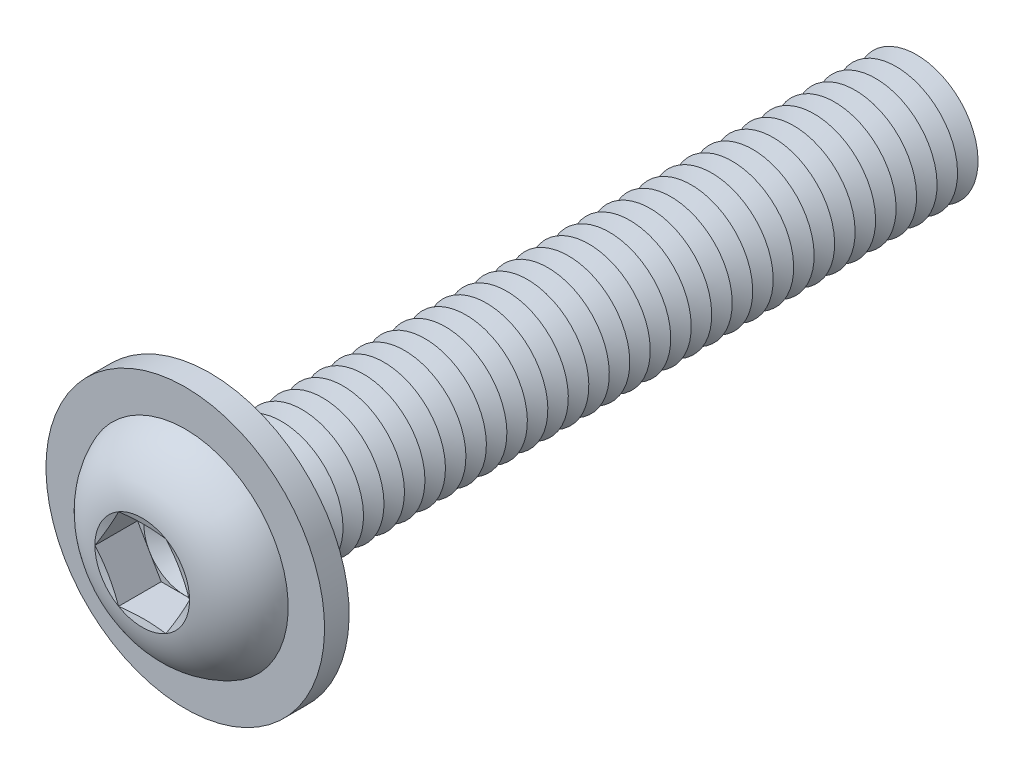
ISO-10303-21;
HEADER;
FILE_DESCRIPTION(('STEP AP214'),'2;1');
FILE_NAME('part.step','',(''),(''),'','','');
FILE_SCHEMA(('AUTOMOTIVE_DESIGN { 1 0 10303 214 1 1 1 1 }'));
ENDSEC;
DATA;
#1=APPLICATION_CONTEXT('core data for automotive mechanical design processes');
#2=APPLICATION_PROTOCOL_DEFINITION('international standard','automotive_design',2000,#1);
#3=PRODUCT_CONTEXT('',#1,'mechanical');
#4=PRODUCT('Part','Part','',(#3));
#5=PRODUCT_RELATED_PRODUCT_CATEGORY('part','',(#4));
#6=PRODUCT_DEFINITION_FORMATION('','',#4);
#7=PRODUCT_DEFINITION_CONTEXT('part definition',#1,'design');
#8=PRODUCT_DEFINITION('design','',#6,#7);
#9=PRODUCT_DEFINITION_SHAPE('','',#8);
#10=(LENGTH_UNIT() NAMED_UNIT(*) SI_UNIT(.MILLI.,.METRE.));
#11=(NAMED_UNIT(*) PLANE_ANGLE_UNIT() SI_UNIT($,.RADIAN.));
#12=(NAMED_UNIT(*) SI_UNIT($,.STERADIAN.) SOLID_ANGLE_UNIT());
#13=UNCERTAINTY_MEASURE_WITH_UNIT(LENGTH_MEASURE(1.E-05),#10,'distance_accuracy_value','');
#14=(GEOMETRIC_REPRESENTATION_CONTEXT(3) GLOBAL_UNCERTAINTY_ASSIGNED_CONTEXT((#13)) GLOBAL_UNIT_ASSIGNED_CONTEXT((#10,
#11,#12)) REPRESENTATION_CONTEXT('',''));
#15=CARTESIAN_POINT('',(0.,0.,0.));
#16=DIRECTION('',(0.,0.,1.));
#17=DIRECTION('',(1.,0.,0.));
#18=AXIS2_PLACEMENT_3D('',#15,#16,#17);
#19=CARTESIAN_POINT('',(0.,0.,-31.5));
#20=DIRECTION('',(0.,0.,1.));
#21=DIRECTION('',(0.,-1.,0.));
#22=AXIS2_PLACEMENT_3D('',#19,#20,#21);
#23=CONICAL_SURFACE('',#22,2.99999999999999,1.0471975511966);
#24=CARTESIAN_POINT('',(0.,0.,-32.));
#25=DIRECTION('',(0.,0.,1.));
#26=DIRECTION('',(0.,-1.,0.));
#27=AXIS2_PLACEMENT_3D('',#24,#25,#26);
#28=CIRCLE('',#27,2.13397459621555);
#29=CARTESIAN_POINT('',(0.,-2.13397459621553,-32.));
#30=VERTEX_POINT('',#29);
#31=EDGE_CURVE('E489',#30,#30,#28,.T.);
#32=ORIENTED_EDGE('',*,*,#31,.T.);
#33=EDGE_LOOP('',(#32));
#34=FACE_BOUND('',#33,.T.);
#35=CARTESIAN_POINT('',(0.,0.,-31.5));
#36=DIRECTION('',(0.,0.,1.));
#37=DIRECTION('',(0.,-1.,0.));
#38=AXIS2_PLACEMENT_3D('',#35,#36,#37);
#39=CIRCLE('',#38,2.99999999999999);
#40=CARTESIAN_POINT('',(0.,-2.99999999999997,-31.5));
#41=VERTEX_POINT('',#40);
#42=EDGE_CURVE('E485',#41,#41,#39,.T.);
#43=ORIENTED_EDGE('',*,*,#42,.F.);
#44=EDGE_LOOP('',(#43));
#45=FACE_BOUND('',#44,.T.);
#46=ADVANCED_FACE('F39',(#34,#45),#23,.T.);
#47=CARTESIAN_POINT('',(0.,0.,-32.));
#48=DIRECTION('',(0.,0.,-1.));
#49=DIRECTION('',(0.,1.,0.));
#50=AXIS2_PLACEMENT_3D('',#47,#48,#49);
#51=CONICAL_SURFACE('',#50,2.13397459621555,1.0471975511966);
#52=CARTESIAN_POINT('',(0.,0.,-32.5));
#53=DIRECTION('',(0.,0.,1.));
#54=DIRECTION('',(0.,-1.,0.));
#55=AXIS2_PLACEMENT_3D('',#52,#53,#54);
#56=CIRCLE('',#55,2.99999999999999);
#57=CARTESIAN_POINT('',(0.,-2.99999999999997,-32.5));
#58=VERTEX_POINT('',#57);
#59=EDGE_CURVE('E493',#58,#58,#56,.T.);
#60=ORIENTED_EDGE('',*,*,#59,.T.);
#61=EDGE_LOOP('',(#60));
#62=FACE_BOUND('',#61,.T.);
#63=ORIENTED_EDGE('',*,*,#31,.F.);
#64=EDGE_LOOP('',(#63));
#65=FACE_BOUND('',#64,.T.);
#66=ADVANCED_FACE('F607',(#62,#65),#51,.T.);
#67=CARTESIAN_POINT('',(0.,3.,-35.));
#68=DIRECTION('',(0.,0.,-1.));
#69=DIRECTION('',(0.,1.,0.));
#70=AXIS2_PLACEMENT_3D('',#67,#68,#69);
#71=PLANE('',#70);
#72=CARTESIAN_POINT('',(0.,0.,-35.));
#73=DIRECTION('',(0.,0.,1.));
#74=DIRECTION('',(0.,-1.,0.));
#75=AXIS2_PLACEMENT_3D('',#72,#73,#74);
#76=CIRCLE('',#75,2.13397459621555);
#77=CARTESIAN_POINT('',(0.,-2.13397459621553,-35.));
#78=VERTEX_POINT('',#77);
#79=EDGE_CURVE('E513',#78,#78,#76,.T.);
#80=ORIENTED_EDGE('',*,*,#79,.F.);
#81=EDGE_LOOP('',(#80));
#82=FACE_BOUND('',#81,.T.);
#83=ADVANCED_FACE('F613',(#82),#71,.T.);
#84=CARTESIAN_POINT('',(0.,0.,-34.5));
#85=DIRECTION('',(0.,0.,1.));
#86=DIRECTION('',(0.,-1.,0.));
#87=AXIS2_PLACEMENT_3D('',#84,#85,#86);
#88=CONICAL_SURFACE('',#87,2.99999999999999,1.0471975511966);
#89=ORIENTED_EDGE('',*,*,#79,.T.);
#90=EDGE_LOOP('',(#89));
#91=FACE_BOUND('',#90,.T.);
#92=CARTESIAN_POINT('',(0.,0.,-34.5));
#93=DIRECTION('',(0.,0.,1.));
#94=DIRECTION('',(0.,-1.,0.));
#95=AXIS2_PLACEMENT_3D('',#92,#93,#94);
#96=CIRCLE('',#95,2.99999999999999);
#97=CARTESIAN_POINT('',(0.,-2.99999999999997,-34.5));
#98=VERTEX_POINT('',#97);
#99=EDGE_CURVE('E509',#98,#98,#96,.T.);
#100=ORIENTED_EDGE('',*,*,#99,.F.);
#101=EDGE_LOOP('',(#100));
#102=FACE_BOUND('',#101,.T.);
#103=ADVANCED_FACE('F632',(#91,#102),#88,.T.);
#104=CARTESIAN_POINT('',(0.,0.,-34.));
#105=DIRECTION('',(0.,0.,-1.));
#106=DIRECTION('',(0.,1.,0.));
#107=AXIS2_PLACEMENT_3D('',#104,#105,#106);
#108=CONICAL_SURFACE('',#107,2.13397459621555,1.0471975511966);
#109=ORIENTED_EDGE('',*,*,#99,.T.);
#110=EDGE_LOOP('',(#109));
#111=FACE_BOUND('',#110,.T.);
#112=CARTESIAN_POINT('',(0.,0.,-34.));
#113=DIRECTION('',(0.,0.,1.));
#114=DIRECTION('',(0.,-1.,0.));
#115=AXIS2_PLACEMENT_3D('',#112,#113,#114);
#116=CIRCLE('',#115,2.13397459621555);
#117=CARTESIAN_POINT('',(0.,-2.13397459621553,-34.));
#118=VERTEX_POINT('',#117);
#119=EDGE_CURVE('E505',#118,#118,#116,.T.);
#120=ORIENTED_EDGE('',*,*,#119,.F.);
#121=EDGE_LOOP('',(#120));
#122=FACE_BOUND('',#121,.T.);
#123=ADVANCED_FACE('F629',(#111,#122),#108,.T.);
#124=CARTESIAN_POINT('',(0.,0.,-33.5));
#125=DIRECTION('',(0.,0.,1.));
#126=DIRECTION('',(0.,-1.,0.));
#127=AXIS2_PLACEMENT_3D('',#124,#125,#126);
#128=CONICAL_SURFACE('',#127,2.99999999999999,1.0471975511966);
#129=ORIENTED_EDGE('',*,*,#119,.T.);
#130=EDGE_LOOP('',(#129));
#131=FACE_BOUND('',#130,.T.);
#132=CARTESIAN_POINT('',(0.,0.,-33.5));
#133=DIRECTION('',(0.,0.,1.));
#134=DIRECTION('',(0.,-1.,0.));
#135=AXIS2_PLACEMENT_3D('',#132,#133,#134);
#136=CIRCLE('',#135,2.99999999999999);
#137=CARTESIAN_POINT('',(0.,-2.99999999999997,-33.5));
#138=VERTEX_POINT('',#137);
#139=EDGE_CURVE('E501',#138,#138,#136,.T.);
#140=ORIENTED_EDGE('',*,*,#139,.F.);
#141=EDGE_LOOP('',(#140));
#142=FACE_BOUND('',#141,.T.);
#143=ADVANCED_FACE('F623',(#131,#142),#128,.T.);
#144=CARTESIAN_POINT('',(0.,0.,-33.));
#145=DIRECTION('',(0.,0.,-1.));
#146=DIRECTION('',(0.,1.,0.));
#147=AXIS2_PLACEMENT_3D('',#144,#145,#146);
#148=CONICAL_SURFACE('',#147,2.13397459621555,1.0471975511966);
#149=ORIENTED_EDGE('',*,*,#139,.T.);
#150=EDGE_LOOP('',(#149));
#151=FACE_BOUND('',#150,.T.);
#152=CARTESIAN_POINT('',(0.,0.,-33.));
#153=DIRECTION('',(0.,0.,1.));
#154=DIRECTION('',(0.,-1.,0.));
#155=AXIS2_PLACEMENT_3D('',#152,#153,#154);
#156=CIRCLE('',#155,2.13397459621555);
#157=CARTESIAN_POINT('',(0.,-2.13397459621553,-33.));
#158=VERTEX_POINT('',#157);
#159=EDGE_CURVE('E497',#158,#158,#156,.T.);
#160=ORIENTED_EDGE('',*,*,#159,.F.);
#161=EDGE_LOOP('',(#160));
#162=FACE_BOUND('',#161,.T.);
#163=ADVANCED_FACE('F619',(#151,#162),#148,.T.);
#164=CARTESIAN_POINT('',(0.,0.,-32.5));
#165=DIRECTION('',(0.,0.,1.));
#166=DIRECTION('',(0.,-1.,0.));
#167=AXIS2_PLACEMENT_3D('',#164,#165,#166);
#168=CONICAL_SURFACE('',#167,2.99999999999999,1.0471975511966);
#169=ORIENTED_EDGE('',*,*,#159,.T.);
#170=EDGE_LOOP('',(#169));
#171=FACE_BOUND('',#170,.T.);
#172=ORIENTED_EDGE('',*,*,#59,.F.);
#173=EDGE_LOOP('',(#172));
#174=FACE_BOUND('',#173,.T.);
#175=ADVANCED_FACE('F622',(#171,#174),#168,.T.);
#176=CARTESIAN_POINT('',(0.,0.,-30.5));
#177=DIRECTION('',(0.,0.,1.));
#178=DIRECTION('',(0.,-1.,0.));
#179=AXIS2_PLACEMENT_3D('',#176,#177,#178);
#180=CONICAL_SURFACE('',#179,2.99999999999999,1.0471975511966);
#181=CARTESIAN_POINT('',(0.,0.,-31.));
#182=DIRECTION('',(0.,0.,1.));
#183=DIRECTION('',(0.,-1.,0.));
#184=AXIS2_PLACEMENT_3D('',#181,#182,#183);
#185=CIRCLE('',#184,2.13397459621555);
#186=CARTESIAN_POINT('',(0.,-2.13397459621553,-31.));
#187=VERTEX_POINT('',#186);
#188=EDGE_CURVE('E481',#187,#187,#185,.T.);
#189=ORIENTED_EDGE('',*,*,#188,.T.);
#190=EDGE_LOOP('',(#189));
#191=FACE_BOUND('',#190,.T.);
#192=CARTESIAN_POINT('',(0.,0.,-30.5));
#193=DIRECTION('',(0.,0.,1.));
#194=DIRECTION('',(0.,-1.,0.));
#195=AXIS2_PLACEMENT_3D('',#192,#193,#194);
#196=CIRCLE('',#195,2.99999999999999);
#197=CARTESIAN_POINT('',(0.,-2.99999999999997,-30.5));
#198=VERTEX_POINT('',#197);
#199=EDGE_CURVE('E477',#198,#198,#196,.T.);
#200=ORIENTED_EDGE('',*,*,#199,.F.);
#201=EDGE_LOOP('',(#200));
#202=FACE_BOUND('',#201,.T.);
#203=ADVANCED_FACE('F627',(#191,#202),#180,.T.);
#204=CARTESIAN_POINT('',(0.,0.,-31.));
#205=DIRECTION('',(0.,0.,-1.));
#206=DIRECTION('',(0.,1.,0.));
#207=AXIS2_PLACEMENT_3D('',#204,#205,#206);
#208=CONICAL_SURFACE('',#207,2.13397459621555,1.0471975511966);
#209=ORIENTED_EDGE('',*,*,#42,.T.);
#210=EDGE_LOOP('',(#209));
#211=FACE_BOUND('',#210,.T.);
#212=ORIENTED_EDGE('',*,*,#188,.F.);
#213=EDGE_LOOP('',(#212));
#214=FACE_BOUND('',#213,.T.);
#215=ADVANCED_FACE('F678',(#211,#214),#208,.T.);
#216=CARTESIAN_POINT('',(0.,0.,-29.5));
#217=DIRECTION('',(0.,0.,1.));
#218=DIRECTION('',(0.,-1.,0.));
#219=AXIS2_PLACEMENT_3D('',#216,#217,#218);
#220=CONICAL_SURFACE('',#219,2.99999999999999,1.0471975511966);
#221=CARTESIAN_POINT('',(0.,0.,-30.));
#222=DIRECTION('',(0.,0.,1.));
#223=DIRECTION('',(0.,-1.,0.));
#224=AXIS2_PLACEMENT_3D('',#221,#222,#223);
#225=CIRCLE('',#224,2.13397459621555);
#226=CARTESIAN_POINT('',(0.,-2.13397459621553,-30.));
#227=VERTEX_POINT('',#226);
#228=EDGE_CURVE('E473',#227,#227,#225,.T.);
#229=ORIENTED_EDGE('',*,*,#228,.T.);
#230=EDGE_LOOP('',(#229));
#231=FACE_BOUND('',#230,.T.);
#232=CARTESIAN_POINT('',(0.,0.,-29.5));
#233=DIRECTION('',(0.,0.,1.));
#234=DIRECTION('',(0.,-1.,0.));
#235=AXIS2_PLACEMENT_3D('',#232,#233,#234);
#236=CIRCLE('',#235,2.99999999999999);
#237=CARTESIAN_POINT('',(0.,-2.99999999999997,-29.5));
#238=VERTEX_POINT('',#237);
#239=EDGE_CURVE('E469',#238,#238,#236,.T.);
#240=ORIENTED_EDGE('',*,*,#239,.F.);
#241=EDGE_LOOP('',(#240));
#242=FACE_BOUND('',#241,.T.);
#243=ADVANCED_FACE('F684',(#231,#242),#220,.T.);
#244=CARTESIAN_POINT('',(0.,0.,-30.));
#245=DIRECTION('',(0.,0.,-1.));
#246=DIRECTION('',(0.,1.,0.));
#247=AXIS2_PLACEMENT_3D('',#244,#245,#246);
#248=CONICAL_SURFACE('',#247,2.13397459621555,1.0471975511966);
#249=ORIENTED_EDGE('',*,*,#199,.T.);
#250=EDGE_LOOP('',(#249));
#251=FACE_BOUND('',#250,.T.);
#252=ORIENTED_EDGE('',*,*,#228,.F.);
#253=EDGE_LOOP('',(#252));
#254=FACE_BOUND('',#253,.T.);
#255=ADVANCED_FACE('F691',(#251,#254),#248,.T.);
#256=CARTESIAN_POINT('',(0.,0.,-28.5));
#257=DIRECTION('',(0.,0.,1.));
#258=DIRECTION('',(0.,-1.,0.));
#259=AXIS2_PLACEMENT_3D('',#256,#257,#258);
#260=CONICAL_SURFACE('',#259,2.99999999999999,1.0471975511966);
#261=CARTESIAN_POINT('',(0.,0.,-29.));
#262=DIRECTION('',(0.,0.,1.));
#263=DIRECTION('',(0.,-1.,0.));
#264=AXIS2_PLACEMENT_3D('',#261,#262,#263);
#265=CIRCLE('',#264,2.13397459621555);
#266=CARTESIAN_POINT('',(0.,-2.13397459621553,-29.));
#267=VERTEX_POINT('',#266);
#268=EDGE_CURVE('E465',#267,#267,#265,.T.);
#269=ORIENTED_EDGE('',*,*,#268,.T.);
#270=EDGE_LOOP('',(#269));
#271=FACE_BOUND('',#270,.T.);
#272=CARTESIAN_POINT('',(0.,0.,-28.5));
#273=DIRECTION('',(0.,0.,1.));
#274=DIRECTION('',(0.,-1.,0.));
#275=AXIS2_PLACEMENT_3D('',#272,#273,#274);
#276=CIRCLE('',#275,2.99999999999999);
#277=CARTESIAN_POINT('',(0.,-2.99999999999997,-28.5));
#278=VERTEX_POINT('',#277);
#279=EDGE_CURVE('E462',#278,#278,#276,.T.);
#280=ORIENTED_EDGE('',*,*,#279,.F.);
#281=EDGE_LOOP('',(#280));
#282=FACE_BOUND('',#281,.T.);
#283=ADVANCED_FACE('F698',(#271,#282),#260,.T.);
#284=CARTESIAN_POINT('',(0.,0.,-29.));
#285=DIRECTION('',(0.,0.,-1.));
#286=DIRECTION('',(0.,1.,0.));
#287=AXIS2_PLACEMENT_3D('',#284,#285,#286);
#288=CONICAL_SURFACE('',#287,2.13397459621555,1.0471975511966);
#289=ORIENTED_EDGE('',*,*,#239,.T.);
#290=EDGE_LOOP('',(#289));
#291=FACE_BOUND('',#290,.T.);
#292=ORIENTED_EDGE('',*,*,#268,.F.);
#293=EDGE_LOOP('',(#292));
#294=FACE_BOUND('',#293,.T.);
#295=ADVANCED_FACE('F705',(#291,#294),#288,.T.);
#296=CARTESIAN_POINT('',(0.,0.,-27.5));
#297=DIRECTION('',(0.,0.,1.));
#298=DIRECTION('',(0.,-1.,0.));
#299=AXIS2_PLACEMENT_3D('',#296,#297,#298);
#300=CONICAL_SURFACE('',#299,2.99999999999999,1.0471975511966);
#301=CARTESIAN_POINT('',(0.,0.,-28.));
#302=DIRECTION('',(0.,0.,1.));
#303=DIRECTION('',(0.,-1.,0.));
#304=AXIS2_PLACEMENT_3D('',#301,#302,#303);
#305=CIRCLE('',#304,2.13397459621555);
#306=CARTESIAN_POINT('',(0.,-2.13397459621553,-28.));
#307=VERTEX_POINT('',#306);
#308=EDGE_CURVE('E458',#307,#307,#305,.T.);
#309=ORIENTED_EDGE('',*,*,#308,.T.);
#310=EDGE_LOOP('',(#309));
#311=FACE_BOUND('',#310,.T.);
#312=CARTESIAN_POINT('',(0.,0.,-27.5));
#313=DIRECTION('',(0.,0.,1.));
#314=DIRECTION('',(0.,-1.,0.));
#315=AXIS2_PLACEMENT_3D('',#312,#313,#314);
#316=CIRCLE('',#315,2.99999999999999);
#317=CARTESIAN_POINT('',(0.,-2.99999999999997,-27.5));
#318=VERTEX_POINT('',#317);
#319=EDGE_CURVE('E454',#318,#318,#316,.T.);
#320=ORIENTED_EDGE('',*,*,#319,.F.);
#321=EDGE_LOOP('',(#320));
#322=FACE_BOUND('',#321,.T.);
#323=ADVANCED_FACE('F712',(#311,#322),#300,.T.);
#324=CARTESIAN_POINT('',(0.,0.,-28.));
#325=DIRECTION('',(0.,0.,-1.));
#326=DIRECTION('',(0.,1.,0.));
#327=AXIS2_PLACEMENT_3D('',#324,#325,#326);
#328=CONICAL_SURFACE('',#327,2.13397459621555,1.0471975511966);
#329=ORIENTED_EDGE('',*,*,#279,.T.);
#330=EDGE_LOOP('',(#329));
#331=FACE_BOUND('',#330,.T.);
#332=ORIENTED_EDGE('',*,*,#308,.F.);
#333=EDGE_LOOP('',(#332));
#334=FACE_BOUND('',#333,.T.);
#335=ADVANCED_FACE('F719',(#331,#334),#328,.T.);
#336=CARTESIAN_POINT('',(0.,0.,-26.5));
#337=DIRECTION('',(0.,0.,1.));
#338=DIRECTION('',(0.,-1.,0.));
#339=AXIS2_PLACEMENT_3D('',#336,#337,#338);
#340=CONICAL_SURFACE('',#339,2.99999999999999,1.0471975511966);
#341=CARTESIAN_POINT('',(0.,0.,-27.));
#342=DIRECTION('',(0.,0.,1.));
#343=DIRECTION('',(0.,-1.,0.));
#344=AXIS2_PLACEMENT_3D('',#341,#342,#343);
#345=CIRCLE('',#344,2.13397459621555);
#346=CARTESIAN_POINT('',(0.,-2.13397459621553,-27.));
#347=VERTEX_POINT('',#346);
#348=EDGE_CURVE('E450',#347,#347,#345,.T.);
#349=ORIENTED_EDGE('',*,*,#348,.T.);
#350=EDGE_LOOP('',(#349));
#351=FACE_BOUND('',#350,.T.);
#352=CARTESIAN_POINT('',(0.,0.,-26.5));
#353=DIRECTION('',(0.,0.,1.));
#354=DIRECTION('',(0.,-1.,0.));
#355=AXIS2_PLACEMENT_3D('',#352,#353,#354);
#356=CIRCLE('',#355,2.99999999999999);
#357=CARTESIAN_POINT('',(0.,-2.99999999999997,-26.5));
#358=VERTEX_POINT('',#357);
#359=EDGE_CURVE('E446',#358,#358,#356,.T.);
#360=ORIENTED_EDGE('',*,*,#359,.F.);
#361=EDGE_LOOP('',(#360));
#362=FACE_BOUND('',#361,.T.);
#363=ADVANCED_FACE('F726',(#351,#362),#340,.T.);
#364=CARTESIAN_POINT('',(0.,0.,-27.));
#365=DIRECTION('',(0.,0.,-1.));
#366=DIRECTION('',(0.,1.,0.));
#367=AXIS2_PLACEMENT_3D('',#364,#365,#366);
#368=CONICAL_SURFACE('',#367,2.13397459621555,1.0471975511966);
#369=ORIENTED_EDGE('',*,*,#319,.T.);
#370=EDGE_LOOP('',(#369));
#371=FACE_BOUND('',#370,.T.);
#372=ORIENTED_EDGE('',*,*,#348,.F.);
#373=EDGE_LOOP('',(#372));
#374=FACE_BOUND('',#373,.T.);
#375=ADVANCED_FACE('F733',(#371,#374),#368,.T.);
#376=CARTESIAN_POINT('',(0.,0.,-25.5));
#377=DIRECTION('',(0.,0.,1.));
#378=DIRECTION('',(0.,-1.,0.));
#379=AXIS2_PLACEMENT_3D('',#376,#377,#378);
#380=CONICAL_SURFACE('',#379,2.99999999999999,1.0471975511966);
#381=CARTESIAN_POINT('',(0.,0.,-26.));
#382=DIRECTION('',(0.,0.,1.));
#383=DIRECTION('',(0.,-1.,0.));
#384=AXIS2_PLACEMENT_3D('',#381,#382,#383);
#385=CIRCLE('',#384,2.13397459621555);
#386=CARTESIAN_POINT('',(0.,-2.13397459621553,-26.));
#387=VERTEX_POINT('',#386);
#388=EDGE_CURVE('E442',#387,#387,#385,.T.);
#389=ORIENTED_EDGE('',*,*,#388,.T.);
#390=EDGE_LOOP('',(#389));
#391=FACE_BOUND('',#390,.T.);
#392=CARTESIAN_POINT('',(0.,0.,-25.5));
#393=DIRECTION('',(0.,0.,1.));
#394=DIRECTION('',(0.,-1.,0.));
#395=AXIS2_PLACEMENT_3D('',#392,#393,#394);
#396=CIRCLE('',#395,2.99999999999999);
#397=CARTESIAN_POINT('',(0.,-2.99999999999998,-25.5));
#398=VERTEX_POINT('',#397);
#399=EDGE_CURVE('E438',#398,#398,#396,.T.);
#400=ORIENTED_EDGE('',*,*,#399,.F.);
#401=EDGE_LOOP('',(#400));
#402=FACE_BOUND('',#401,.T.);
#403=ADVANCED_FACE('F740',(#391,#402),#380,.T.);
#404=CARTESIAN_POINT('',(0.,0.,-26.));
#405=DIRECTION('',(0.,0.,-1.));
#406=DIRECTION('',(0.,1.,0.));
#407=AXIS2_PLACEMENT_3D('',#404,#405,#406);
#408=CONICAL_SURFACE('',#407,2.13397459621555,1.0471975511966);
#409=ORIENTED_EDGE('',*,*,#359,.T.);
#410=EDGE_LOOP('',(#409));
#411=FACE_BOUND('',#410,.T.);
#412=ORIENTED_EDGE('',*,*,#388,.F.);
#413=EDGE_LOOP('',(#412));
#414=FACE_BOUND('',#413,.T.);
#415=ADVANCED_FACE('F747',(#411,#414),#408,.T.);
#416=CARTESIAN_POINT('',(0.,0.,-24.5));
#417=DIRECTION('',(0.,0.,1.));
#418=DIRECTION('',(0.,-1.,0.));
#419=AXIS2_PLACEMENT_3D('',#416,#417,#418);
#420=CONICAL_SURFACE('',#419,2.99999999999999,1.0471975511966);
#421=CARTESIAN_POINT('',(0.,0.,-25.));
#422=DIRECTION('',(0.,0.,1.));
#423=DIRECTION('',(0.,-1.,0.));
#424=AXIS2_PLACEMENT_3D('',#421,#422,#423);
#425=CIRCLE('',#424,2.13397459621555);
#426=CARTESIAN_POINT('',(0.,-2.13397459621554,-25.));
#427=VERTEX_POINT('',#426);
#428=EDGE_CURVE('E434',#427,#427,#425,.T.);
#429=ORIENTED_EDGE('',*,*,#428,.T.);
#430=EDGE_LOOP('',(#429));
#431=FACE_BOUND('',#430,.T.);
#432=CARTESIAN_POINT('',(0.,0.,-24.5));
#433=DIRECTION('',(0.,0.,1.));
#434=DIRECTION('',(0.,-1.,0.));
#435=AXIS2_PLACEMENT_3D('',#432,#433,#434);
#436=CIRCLE('',#435,2.99999999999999);
#437=CARTESIAN_POINT('',(0.,-2.99999999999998,-24.5));
#438=VERTEX_POINT('',#437);
#439=EDGE_CURVE('E430',#438,#438,#436,.T.);
#440=ORIENTED_EDGE('',*,*,#439,.F.);
#441=EDGE_LOOP('',(#440));
#442=FACE_BOUND('',#441,.T.);
#443=ADVANCED_FACE('F754',(#431,#442),#420,.T.);
#444=CARTESIAN_POINT('',(0.,0.,-25.));
#445=DIRECTION('',(0.,0.,-1.));
#446=DIRECTION('',(0.,1.,0.));
#447=AXIS2_PLACEMENT_3D('',#444,#445,#446);
#448=CONICAL_SURFACE('',#447,2.13397459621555,1.0471975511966);
#449=ORIENTED_EDGE('',*,*,#399,.T.);
#450=EDGE_LOOP('',(#449));
#451=FACE_BOUND('',#450,.T.);
#452=ORIENTED_EDGE('',*,*,#428,.F.);
#453=EDGE_LOOP('',(#452));
#454=FACE_BOUND('',#453,.T.);
#455=ADVANCED_FACE('F761',(#451,#454),#448,.T.);
#456=CARTESIAN_POINT('',(0.,0.,-23.5));
#457=DIRECTION('',(0.,0.,1.));
#458=DIRECTION('',(0.,-1.,0.));
#459=AXIS2_PLACEMENT_3D('',#456,#457,#458);
#460=CONICAL_SURFACE('',#459,2.99999999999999,1.0471975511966);
#461=CARTESIAN_POINT('',(0.,0.,-24.));
#462=DIRECTION('',(0.,0.,1.));
#463=DIRECTION('',(0.,-1.,0.));
#464=AXIS2_PLACEMENT_3D('',#461,#462,#463);
#465=CIRCLE('',#464,2.13397459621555);
#466=CARTESIAN_POINT('',(0.,-2.13397459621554,-24.));
#467=VERTEX_POINT('',#466);
#468=EDGE_CURVE('E426',#467,#467,#465,.T.);
#469=ORIENTED_EDGE('',*,*,#468,.T.);
#470=EDGE_LOOP('',(#469));
#471=FACE_BOUND('',#470,.T.);
#472=CARTESIAN_POINT('',(0.,0.,-23.5));
#473=DIRECTION('',(0.,0.,1.));
#474=DIRECTION('',(0.,-1.,0.));
#475=AXIS2_PLACEMENT_3D('',#472,#473,#474);
#476=CIRCLE('',#475,2.99999999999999);
#477=CARTESIAN_POINT('',(0.,-2.99999999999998,-23.5));
#478=VERTEX_POINT('',#477);
#479=EDGE_CURVE('E422',#478,#478,#476,.T.);
#480=ORIENTED_EDGE('',*,*,#479,.F.);
#481=EDGE_LOOP('',(#480));
#482=FACE_BOUND('',#481,.T.);
#483=ADVANCED_FACE('F768',(#471,#482),#460,.T.);
#484=CARTESIAN_POINT('',(0.,0.,-24.));
#485=DIRECTION('',(0.,0.,-1.));
#486=DIRECTION('',(0.,1.,0.));
#487=AXIS2_PLACEMENT_3D('',#484,#485,#486);
#488=CONICAL_SURFACE('',#487,2.13397459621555,1.0471975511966);
#489=ORIENTED_EDGE('',*,*,#439,.T.);
#490=EDGE_LOOP('',(#489));
#491=FACE_BOUND('',#490,.T.);
#492=ORIENTED_EDGE('',*,*,#468,.F.);
#493=EDGE_LOOP('',(#492));
#494=FACE_BOUND('',#493,.T.);
#495=ADVANCED_FACE('F775',(#491,#494),#488,.T.);
#496=CARTESIAN_POINT('',(0.,0.,-22.5));
#497=DIRECTION('',(0.,0.,1.));
#498=DIRECTION('',(0.,-1.,0.));
#499=AXIS2_PLACEMENT_3D('',#496,#497,#498);
#500=CONICAL_SURFACE('',#499,2.99999999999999,1.0471975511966);
#501=CARTESIAN_POINT('',(0.,0.,-23.));
#502=DIRECTION('',(0.,0.,1.));
#503=DIRECTION('',(0.,-1.,0.));
#504=AXIS2_PLACEMENT_3D('',#501,#502,#503);
#505=CIRCLE('',#504,2.13397459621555);
#506=CARTESIAN_POINT('',(0.,-2.13397459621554,-23.));
#507=VERTEX_POINT('',#506);
#508=EDGE_CURVE('E418',#507,#507,#505,.T.);
#509=ORIENTED_EDGE('',*,*,#508,.T.);
#510=EDGE_LOOP('',(#509));
#511=FACE_BOUND('',#510,.T.);
#512=CARTESIAN_POINT('',(0.,0.,-22.5));
#513=DIRECTION('',(0.,0.,1.));
#514=DIRECTION('',(0.,-1.,0.));
#515=AXIS2_PLACEMENT_3D('',#512,#513,#514);
#516=CIRCLE('',#515,2.99999999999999);
#517=CARTESIAN_POINT('',(0.,-2.99999999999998,-22.5));
#518=VERTEX_POINT('',#517);
#519=EDGE_CURVE('E414',#518,#518,#516,.T.);
#520=ORIENTED_EDGE('',*,*,#519,.F.);
#521=EDGE_LOOP('',(#520));
#522=FACE_BOUND('',#521,.T.);
#523=ADVANCED_FACE('F782',(#511,#522),#500,.T.);
#524=CARTESIAN_POINT('',(0.,0.,-23.));
#525=DIRECTION('',(0.,0.,-1.));
#526=DIRECTION('',(0.,1.,0.));
#527=AXIS2_PLACEMENT_3D('',#524,#525,#526);
#528=CONICAL_SURFACE('',#527,2.13397459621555,1.0471975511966);
#529=ORIENTED_EDGE('',*,*,#479,.T.);
#530=EDGE_LOOP('',(#529));
#531=FACE_BOUND('',#530,.T.);
#532=ORIENTED_EDGE('',*,*,#508,.F.);
#533=EDGE_LOOP('',(#532));
#534=FACE_BOUND('',#533,.T.);
#535=ADVANCED_FACE('F789',(#531,#534),#528,.T.);
#536=CARTESIAN_POINT('',(0.,0.,-21.5));
#537=DIRECTION('',(0.,0.,1.));
#538=DIRECTION('',(0.,-1.,0.));
#539=AXIS2_PLACEMENT_3D('',#536,#537,#538);
#540=CONICAL_SURFACE('',#539,2.99999999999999,1.0471975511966);
#541=CARTESIAN_POINT('',(0.,0.,-22.));
#542=DIRECTION('',(0.,0.,1.));
#543=DIRECTION('',(0.,-1.,0.));
#544=AXIS2_PLACEMENT_3D('',#541,#542,#543);
#545=CIRCLE('',#544,2.13397459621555);
#546=CARTESIAN_POINT('',(0.,-2.13397459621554,-22.));
#547=VERTEX_POINT('',#546);
#548=EDGE_CURVE('E410',#547,#547,#545,.T.);
#549=ORIENTED_EDGE('',*,*,#548,.T.);
#550=EDGE_LOOP('',(#549));
#551=FACE_BOUND('',#550,.T.);
#552=CARTESIAN_POINT('',(0.,0.,-21.5));
#553=DIRECTION('',(0.,0.,1.));
#554=DIRECTION('',(0.,-1.,0.));
#555=AXIS2_PLACEMENT_3D('',#552,#553,#554);
#556=CIRCLE('',#555,2.99999999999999);
#557=CARTESIAN_POINT('',(0.,-2.99999999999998,-21.5));
#558=VERTEX_POINT('',#557);
#559=EDGE_CURVE('E406',#558,#558,#556,.T.);
#560=ORIENTED_EDGE('',*,*,#559,.F.);
#561=EDGE_LOOP('',(#560));
#562=FACE_BOUND('',#561,.T.);
#563=ADVANCED_FACE('F796',(#551,#562),#540,.T.);
#564=CARTESIAN_POINT('',(0.,0.,-22.));
#565=DIRECTION('',(0.,0.,-1.));
#566=DIRECTION('',(0.,1.,0.));
#567=AXIS2_PLACEMENT_3D('',#564,#565,#566);
#568=CONICAL_SURFACE('',#567,2.13397459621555,1.0471975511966);
#569=ORIENTED_EDGE('',*,*,#519,.T.);
#570=EDGE_LOOP('',(#569));
#571=FACE_BOUND('',#570,.T.);
#572=ORIENTED_EDGE('',*,*,#548,.F.);
#573=EDGE_LOOP('',(#572));
#574=FACE_BOUND('',#573,.T.);
#575=ADVANCED_FACE('F803',(#571,#574),#568,.T.);
#576=CARTESIAN_POINT('',(0.,0.,-20.5));
#577=DIRECTION('',(0.,0.,1.));
#578=DIRECTION('',(0.,-1.,0.));
#579=AXIS2_PLACEMENT_3D('',#576,#577,#578);
#580=CONICAL_SURFACE('',#579,2.99999999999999,1.0471975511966);
#581=CARTESIAN_POINT('',(0.,0.,-21.));
#582=DIRECTION('',(0.,0.,1.));
#583=DIRECTION('',(0.,-1.,0.));
#584=AXIS2_PLACEMENT_3D('',#581,#582,#583);
#585=CIRCLE('',#584,2.13397459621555);
#586=CARTESIAN_POINT('',(0.,-2.13397459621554,-21.));
#587=VERTEX_POINT('',#586);
#588=EDGE_CURVE('E402',#587,#587,#585,.T.);
#589=ORIENTED_EDGE('',*,*,#588,.T.);
#590=EDGE_LOOP('',(#589));
#591=FACE_BOUND('',#590,.T.);
#592=CARTESIAN_POINT('',(0.,0.,-20.5));
#593=DIRECTION('',(0.,0.,1.));
#594=DIRECTION('',(0.,-1.,0.));
#595=AXIS2_PLACEMENT_3D('',#592,#593,#594);
#596=CIRCLE('',#595,2.99999999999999);
#597=CARTESIAN_POINT('',(0.,-2.99999999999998,-20.5));
#598=VERTEX_POINT('',#597);
#599=EDGE_CURVE('E398',#598,#598,#596,.T.);
#600=ORIENTED_EDGE('',*,*,#599,.F.);
#601=EDGE_LOOP('',(#600));
#602=FACE_BOUND('',#601,.T.);
#603=ADVANCED_FACE('F810',(#591,#602),#580,.T.);
#604=CARTESIAN_POINT('',(0.,0.,-21.));
#605=DIRECTION('',(0.,0.,-1.));
#606=DIRECTION('',(0.,1.,0.));
#607=AXIS2_PLACEMENT_3D('',#604,#605,#606);
#608=CONICAL_SURFACE('',#607,2.13397459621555,1.0471975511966);
#609=ORIENTED_EDGE('',*,*,#559,.T.);
#610=EDGE_LOOP('',(#609));
#611=FACE_BOUND('',#610,.T.);
#612=ORIENTED_EDGE('',*,*,#588,.F.);
#613=EDGE_LOOP('',(#612));
#614=FACE_BOUND('',#613,.T.);
#615=ADVANCED_FACE('F817',(#611,#614),#608,.T.);
#616=CARTESIAN_POINT('',(0.,0.,-19.5));
#617=DIRECTION('',(0.,0.,1.));
#618=DIRECTION('',(0.,-1.,0.));
#619=AXIS2_PLACEMENT_3D('',#616,#617,#618);
#620=CONICAL_SURFACE('',#619,2.99999999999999,1.0471975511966);
#621=CARTESIAN_POINT('',(0.,0.,-20.));
#622=DIRECTION('',(0.,0.,1.));
#623=DIRECTION('',(0.,-1.,0.));
#624=AXIS2_PLACEMENT_3D('',#621,#622,#623);
#625=CIRCLE('',#624,2.13397459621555);
#626=CARTESIAN_POINT('',(0.,-2.13397459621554,-20.));
#627=VERTEX_POINT('',#626);
#628=EDGE_CURVE('E394',#627,#627,#625,.T.);
#629=ORIENTED_EDGE('',*,*,#628,.T.);
#630=EDGE_LOOP('',(#629));
#631=FACE_BOUND('',#630,.T.);
#632=CARTESIAN_POINT('',(0.,0.,-19.5));
#633=DIRECTION('',(0.,0.,1.));
#634=DIRECTION('',(0.,-1.,0.));
#635=AXIS2_PLACEMENT_3D('',#632,#633,#634);
#636=CIRCLE('',#635,2.99999999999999);
#637=CARTESIAN_POINT('',(0.,-2.99999999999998,-19.5));
#638=VERTEX_POINT('',#637);
#639=EDGE_CURVE('E390',#638,#638,#636,.T.);
#640=ORIENTED_EDGE('',*,*,#639,.F.);
#641=EDGE_LOOP('',(#640));
#642=FACE_BOUND('',#641,.T.);
#643=ADVANCED_FACE('F824',(#631,#642),#620,.T.);
#644=CARTESIAN_POINT('',(0.,0.,-20.));
#645=DIRECTION('',(0.,0.,-1.));
#646=DIRECTION('',(0.,1.,0.));
#647=AXIS2_PLACEMENT_3D('',#644,#645,#646);
#648=CONICAL_SURFACE('',#647,2.13397459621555,1.0471975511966);
#649=ORIENTED_EDGE('',*,*,#599,.T.);
#650=EDGE_LOOP('',(#649));
#651=FACE_BOUND('',#650,.T.);
#652=ORIENTED_EDGE('',*,*,#628,.F.);
#653=EDGE_LOOP('',(#652));
#654=FACE_BOUND('',#653,.T.);
#655=ADVANCED_FACE('F831',(#651,#654),#648,.T.);
#656=CARTESIAN_POINT('',(0.,0.,-18.5));
#657=DIRECTION('',(0.,0.,1.));
#658=DIRECTION('',(0.,-1.,0.));
#659=AXIS2_PLACEMENT_3D('',#656,#657,#658);
#660=CONICAL_SURFACE('',#659,2.99999999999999,1.0471975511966);
#661=CARTESIAN_POINT('',(0.,0.,-19.));
#662=DIRECTION('',(0.,0.,1.));
#663=DIRECTION('',(0.,-1.,0.));
#664=AXIS2_PLACEMENT_3D('',#661,#662,#663);
#665=CIRCLE('',#664,2.13397459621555);
#666=CARTESIAN_POINT('',(0.,-2.13397459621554,-19.));
#667=VERTEX_POINT('',#666);
#668=EDGE_CURVE('E386',#667,#667,#665,.T.);
#669=ORIENTED_EDGE('',*,*,#668,.T.);
#670=EDGE_LOOP('',(#669));
#671=FACE_BOUND('',#670,.T.);
#672=CARTESIAN_POINT('',(0.,0.,-18.5));
#673=DIRECTION('',(0.,0.,1.));
#674=DIRECTION('',(0.,-1.,0.));
#675=AXIS2_PLACEMENT_3D('',#672,#673,#674);
#676=CIRCLE('',#675,2.99999999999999);
#677=CARTESIAN_POINT('',(0.,-2.99999999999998,-18.5));
#678=VERTEX_POINT('',#677);
#679=EDGE_CURVE('E382',#678,#678,#676,.T.);
#680=ORIENTED_EDGE('',*,*,#679,.F.);
#681=EDGE_LOOP('',(#680));
#682=FACE_BOUND('',#681,.T.);
#683=ADVANCED_FACE('F838',(#671,#682),#660,.T.);
#684=CARTESIAN_POINT('',(0.,0.,-19.));
#685=DIRECTION('',(0.,0.,-1.));
#686=DIRECTION('',(0.,1.,0.));
#687=AXIS2_PLACEMENT_3D('',#684,#685,#686);
#688=CONICAL_SURFACE('',#687,2.13397459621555,1.0471975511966);
#689=ORIENTED_EDGE('',*,*,#639,.T.);
#690=EDGE_LOOP('',(#689));
#691=FACE_BOUND('',#690,.T.);
#692=ORIENTED_EDGE('',*,*,#668,.F.);
#693=EDGE_LOOP('',(#692));
#694=FACE_BOUND('',#693,.T.);
#695=ADVANCED_FACE('F845',(#691,#694),#688,.T.);
#696=CARTESIAN_POINT('',(0.,0.,-17.5));
#697=DIRECTION('',(0.,0.,1.));
#698=DIRECTION('',(0.,-1.,0.));
#699=AXIS2_PLACEMENT_3D('',#696,#697,#698);
#700=CONICAL_SURFACE('',#699,2.99999999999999,1.0471975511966);
#701=CARTESIAN_POINT('',(0.,0.,-18.));
#702=DIRECTION('',(0.,0.,1.));
#703=DIRECTION('',(0.,-1.,0.));
#704=AXIS2_PLACEMENT_3D('',#701,#702,#703);
#705=CIRCLE('',#704,2.13397459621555);
#706=CARTESIAN_POINT('',(0.,-2.13397459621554,-18.));
#707=VERTEX_POINT('',#706);
#708=EDGE_CURVE('E378',#707,#707,#705,.T.);
#709=ORIENTED_EDGE('',*,*,#708,.T.);
#710=EDGE_LOOP('',(#709));
#711=FACE_BOUND('',#710,.T.);
#712=CARTESIAN_POINT('',(0.,0.,-17.5));
#713=DIRECTION('',(0.,0.,1.));
#714=DIRECTION('',(0.,-1.,0.));
#715=AXIS2_PLACEMENT_3D('',#712,#713,#714);
#716=CIRCLE('',#715,2.99999999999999);
#717=CARTESIAN_POINT('',(0.,-2.99999999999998,-17.5));
#718=VERTEX_POINT('',#717);
#719=EDGE_CURVE('E374',#718,#718,#716,.T.);
#720=ORIENTED_EDGE('',*,*,#719,.F.);
#721=EDGE_LOOP('',(#720));
#722=FACE_BOUND('',#721,.T.);
#723=ADVANCED_FACE('F852',(#711,#722),#700,.T.);
#724=CARTESIAN_POINT('',(0.,0.,-18.));
#725=DIRECTION('',(0.,0.,-1.));
#726=DIRECTION('',(0.,1.,0.));
#727=AXIS2_PLACEMENT_3D('',#724,#725,#726);
#728=CONICAL_SURFACE('',#727,2.13397459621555,1.0471975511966);
#729=ORIENTED_EDGE('',*,*,#679,.T.);
#730=EDGE_LOOP('',(#729));
#731=FACE_BOUND('',#730,.T.);
#732=ORIENTED_EDGE('',*,*,#708,.F.);
#733=EDGE_LOOP('',(#732));
#734=FACE_BOUND('',#733,.T.);
#735=ADVANCED_FACE('F859',(#731,#734),#728,.T.);
#736=CARTESIAN_POINT('',(0.,0.,-16.5));
#737=DIRECTION('',(0.,0.,1.));
#738=DIRECTION('',(0.,-1.,0.));
#739=AXIS2_PLACEMENT_3D('',#736,#737,#738);
#740=CONICAL_SURFACE('',#739,2.99999999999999,1.0471975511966);
#741=CARTESIAN_POINT('',(0.,0.,-17.));
#742=DIRECTION('',(0.,0.,1.));
#743=DIRECTION('',(0.,-1.,0.));
#744=AXIS2_PLACEMENT_3D('',#741,#742,#743);
#745=CIRCLE('',#744,2.13397459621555);
#746=CARTESIAN_POINT('',(0.,-2.13397459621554,-17.));
#747=VERTEX_POINT('',#746);
#748=EDGE_CURVE('E370',#747,#747,#745,.T.);
#749=ORIENTED_EDGE('',*,*,#748,.T.);
#750=EDGE_LOOP('',(#749));
#751=FACE_BOUND('',#750,.T.);
#752=CARTESIAN_POINT('',(0.,0.,-16.5));
#753=DIRECTION('',(0.,0.,1.));
#754=DIRECTION('',(0.,-1.,0.));
#755=AXIS2_PLACEMENT_3D('',#752,#753,#754);
#756=CIRCLE('',#755,2.99999999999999);
#757=CARTESIAN_POINT('',(0.,-2.99999999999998,-16.5));
#758=VERTEX_POINT('',#757);
#759=EDGE_CURVE('E366',#758,#758,#756,.T.);
#760=ORIENTED_EDGE('',*,*,#759,.F.);
#761=EDGE_LOOP('',(#760));
#762=FACE_BOUND('',#761,.T.);
#763=ADVANCED_FACE('F866',(#751,#762),#740,.T.);
#764=CARTESIAN_POINT('',(0.,0.,-17.));
#765=DIRECTION('',(0.,0.,-1.));
#766=DIRECTION('',(0.,1.,0.));
#767=AXIS2_PLACEMENT_3D('',#764,#765,#766);
#768=CONICAL_SURFACE('',#767,2.13397459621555,1.0471975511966);
#769=ORIENTED_EDGE('',*,*,#719,.T.);
#770=EDGE_LOOP('',(#769));
#771=FACE_BOUND('',#770,.T.);
#772=ORIENTED_EDGE('',*,*,#748,.F.);
#773=EDGE_LOOP('',(#772));
#774=FACE_BOUND('',#773,.T.);
#775=ADVANCED_FACE('F873',(#771,#774),#768,.T.);
#776=CARTESIAN_POINT('',(0.,0.,-15.5));
#777=DIRECTION('',(0.,0.,1.));
#778=DIRECTION('',(0.,-1.,0.));
#779=AXIS2_PLACEMENT_3D('',#776,#777,#778);
#780=CONICAL_SURFACE('',#779,2.99999999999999,1.0471975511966);
#781=CARTESIAN_POINT('',(0.,0.,-16.));
#782=DIRECTION('',(0.,0.,1.));
#783=DIRECTION('',(0.,-1.,0.));
#784=AXIS2_PLACEMENT_3D('',#781,#782,#783);
#785=CIRCLE('',#784,2.13397459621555);
#786=CARTESIAN_POINT('',(0.,-2.13397459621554,-16.));
#787=VERTEX_POINT('',#786);
#788=EDGE_CURVE('E362',#787,#787,#785,.T.);
#789=ORIENTED_EDGE('',*,*,#788,.T.);
#790=EDGE_LOOP('',(#789));
#791=FACE_BOUND('',#790,.T.);
#792=CARTESIAN_POINT('',(0.,0.,-15.5));
#793=DIRECTION('',(0.,0.,1.));
#794=DIRECTION('',(0.,-1.,0.));
#795=AXIS2_PLACEMENT_3D('',#792,#793,#794);
#796=CIRCLE('',#795,2.99999999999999);
#797=CARTESIAN_POINT('',(0.,-2.99999999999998,-15.5));
#798=VERTEX_POINT('',#797);
#799=EDGE_CURVE('E358',#798,#798,#796,.T.);
#800=ORIENTED_EDGE('',*,*,#799,.F.);
#801=EDGE_LOOP('',(#800));
#802=FACE_BOUND('',#801,.T.);
#803=ADVANCED_FACE('F880',(#791,#802),#780,.T.);
#804=CARTESIAN_POINT('',(0.,0.,-16.));
#805=DIRECTION('',(0.,0.,-1.));
#806=DIRECTION('',(0.,1.,0.));
#807=AXIS2_PLACEMENT_3D('',#804,#805,#806);
#808=CONICAL_SURFACE('',#807,2.13397459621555,1.0471975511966);
#809=ORIENTED_EDGE('',*,*,#759,.T.);
#810=EDGE_LOOP('',(#809));
#811=FACE_BOUND('',#810,.T.);
#812=ORIENTED_EDGE('',*,*,#788,.F.);
#813=EDGE_LOOP('',(#812));
#814=FACE_BOUND('',#813,.T.);
#815=ADVANCED_FACE('F887',(#811,#814),#808,.T.);
#816=CARTESIAN_POINT('',(0.,0.,-14.5));
#817=DIRECTION('',(0.,0.,1.));
#818=DIRECTION('',(0.,-1.,0.));
#819=AXIS2_PLACEMENT_3D('',#816,#817,#818);
#820=CONICAL_SURFACE('',#819,2.99999999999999,1.0471975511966);
#821=CARTESIAN_POINT('',(0.,0.,-15.));
#822=DIRECTION('',(0.,0.,1.));
#823=DIRECTION('',(0.,-1.,0.));
#824=AXIS2_PLACEMENT_3D('',#821,#822,#823);
#825=CIRCLE('',#824,2.13397459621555);
#826=CARTESIAN_POINT('',(0.,-2.13397459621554,-15.));
#827=VERTEX_POINT('',#826);
#828=EDGE_CURVE('E354',#827,#827,#825,.T.);
#829=ORIENTED_EDGE('',*,*,#828,.T.);
#830=EDGE_LOOP('',(#829));
#831=FACE_BOUND('',#830,.T.);
#832=CARTESIAN_POINT('',(0.,0.,-14.5));
#833=DIRECTION('',(0.,0.,1.));
#834=DIRECTION('',(0.,-1.,0.));
#835=AXIS2_PLACEMENT_3D('',#832,#833,#834);
#836=CIRCLE('',#835,2.99999999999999);
#837=CARTESIAN_POINT('',(0.,-2.99999999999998,-14.5));
#838=VERTEX_POINT('',#837);
#839=EDGE_CURVE('E350',#838,#838,#836,.T.);
#840=ORIENTED_EDGE('',*,*,#839,.F.);
#841=EDGE_LOOP('',(#840));
#842=FACE_BOUND('',#841,.T.);
#843=ADVANCED_FACE('F894',(#831,#842),#820,.T.);
#844=CARTESIAN_POINT('',(0.,0.,-15.));
#845=DIRECTION('',(0.,0.,-1.));
#846=DIRECTION('',(0.,1.,0.));
#847=AXIS2_PLACEMENT_3D('',#844,#845,#846);
#848=CONICAL_SURFACE('',#847,2.13397459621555,1.0471975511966);
#849=ORIENTED_EDGE('',*,*,#799,.T.);
#850=EDGE_LOOP('',(#849));
#851=FACE_BOUND('',#850,.T.);
#852=ORIENTED_EDGE('',*,*,#828,.F.);
#853=EDGE_LOOP('',(#852));
#854=FACE_BOUND('',#853,.T.);
#855=ADVANCED_FACE('F901',(#851,#854),#848,.T.);
#856=CARTESIAN_POINT('',(0.,0.,-13.5));
#857=DIRECTION('',(0.,0.,1.));
#858=DIRECTION('',(0.,-1.,0.));
#859=AXIS2_PLACEMENT_3D('',#856,#857,#858);
#860=CONICAL_SURFACE('',#859,2.99999999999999,1.0471975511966);
#861=CARTESIAN_POINT('',(0.,0.,-14.));
#862=DIRECTION('',(0.,0.,1.));
#863=DIRECTION('',(0.,-1.,0.));
#864=AXIS2_PLACEMENT_3D('',#861,#862,#863);
#865=CIRCLE('',#864,2.13397459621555);
#866=CARTESIAN_POINT('',(0.,-2.13397459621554,-14.));
#867=VERTEX_POINT('',#866);
#868=EDGE_CURVE('E346',#867,#867,#865,.T.);
#869=ORIENTED_EDGE('',*,*,#868,.T.);
#870=EDGE_LOOP('',(#869));
#871=FACE_BOUND('',#870,.T.);
#872=CARTESIAN_POINT('',(0.,0.,-13.5));
#873=DIRECTION('',(0.,0.,1.));
#874=DIRECTION('',(0.,-1.,0.));
#875=AXIS2_PLACEMENT_3D('',#872,#873,#874);
#876=CIRCLE('',#875,2.99999999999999);
#877=CARTESIAN_POINT('',(0.,-2.99999999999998,-13.5));
#878=VERTEX_POINT('',#877);
#879=EDGE_CURVE('E342',#878,#878,#876,.T.);
#880=ORIENTED_EDGE('',*,*,#879,.F.);
#881=EDGE_LOOP('',(#880));
#882=FACE_BOUND('',#881,.T.);
#883=ADVANCED_FACE('F908',(#871,#882),#860,.T.);
#884=CARTESIAN_POINT('',(0.,0.,-14.));
#885=DIRECTION('',(0.,0.,-1.));
#886=DIRECTION('',(0.,1.,0.));
#887=AXIS2_PLACEMENT_3D('',#884,#885,#886);
#888=CONICAL_SURFACE('',#887,2.13397459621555,1.0471975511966);
#889=ORIENTED_EDGE('',*,*,#839,.T.);
#890=EDGE_LOOP('',(#889));
#891=FACE_BOUND('',#890,.T.);
#892=ORIENTED_EDGE('',*,*,#868,.F.);
#893=EDGE_LOOP('',(#892));
#894=FACE_BOUND('',#893,.T.);
#895=ADVANCED_FACE('F915',(#891,#894),#888,.T.);
#896=CARTESIAN_POINT('',(0.,0.,-12.5));
#897=DIRECTION('',(0.,0.,1.));
#898=DIRECTION('',(0.,-1.,0.));
#899=AXIS2_PLACEMENT_3D('',#896,#897,#898);
#900=CONICAL_SURFACE('',#899,2.99999999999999,1.0471975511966);
#901=CARTESIAN_POINT('',(0.,0.,-13.));
#902=DIRECTION('',(0.,0.,1.));
#903=DIRECTION('',(0.,-1.,0.));
#904=AXIS2_PLACEMENT_3D('',#901,#902,#903);
#905=CIRCLE('',#904,2.13397459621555);
#906=CARTESIAN_POINT('',(0.,-2.13397459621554,-13.));
#907=VERTEX_POINT('',#906);
#908=EDGE_CURVE('E338',#907,#907,#905,.T.);
#909=ORIENTED_EDGE('',*,*,#908,.T.);
#910=EDGE_LOOP('',(#909));
#911=FACE_BOUND('',#910,.T.);
#912=CARTESIAN_POINT('',(0.,0.,-12.5));
#913=DIRECTION('',(0.,0.,1.));
#914=DIRECTION('',(0.,-1.,0.));
#915=AXIS2_PLACEMENT_3D('',#912,#913,#914);
#916=CIRCLE('',#915,2.99999999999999);
#917=CARTESIAN_POINT('',(0.,-2.99999999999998,-12.5));
#918=VERTEX_POINT('',#917);
#919=EDGE_CURVE('E334',#918,#918,#916,.T.);
#920=ORIENTED_EDGE('',*,*,#919,.F.);
#921=EDGE_LOOP('',(#920));
#922=FACE_BOUND('',#921,.T.);
#923=ADVANCED_FACE('F922',(#911,#922),#900,.T.);
#924=CARTESIAN_POINT('',(0.,0.,-13.));
#925=DIRECTION('',(0.,0.,-1.));
#926=DIRECTION('',(0.,1.,0.));
#927=AXIS2_PLACEMENT_3D('',#924,#925,#926);
#928=CONICAL_SURFACE('',#927,2.13397459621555,1.0471975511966);
#929=ORIENTED_EDGE('',*,*,#879,.T.);
#930=EDGE_LOOP('',(#929));
#931=FACE_BOUND('',#930,.T.);
#932=ORIENTED_EDGE('',*,*,#908,.F.);
#933=EDGE_LOOP('',(#932));
#934=FACE_BOUND('',#933,.T.);
#935=ADVANCED_FACE('F929',(#931,#934),#928,.T.);
#936=CARTESIAN_POINT('',(0.,0.,-11.5));
#937=DIRECTION('',(0.,0.,1.));
#938=DIRECTION('',(0.,-1.,0.));
#939=AXIS2_PLACEMENT_3D('',#936,#937,#938);
#940=CONICAL_SURFACE('',#939,2.99999999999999,1.0471975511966);
#941=CARTESIAN_POINT('',(0.,0.,-12.));
#942=DIRECTION('',(0.,0.,1.));
#943=DIRECTION('',(0.,-1.,0.));
#944=AXIS2_PLACEMENT_3D('',#941,#942,#943);
#945=CIRCLE('',#944,2.13397459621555);
#946=CARTESIAN_POINT('',(0.,-2.13397459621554,-12.));
#947=VERTEX_POINT('',#946);
#948=EDGE_CURVE('E330',#947,#947,#945,.T.);
#949=ORIENTED_EDGE('',*,*,#948,.T.);
#950=EDGE_LOOP('',(#949));
#951=FACE_BOUND('',#950,.T.);
#952=CARTESIAN_POINT('',(0.,0.,-11.5));
#953=DIRECTION('',(0.,0.,1.));
#954=DIRECTION('',(0.,-1.,0.));
#955=AXIS2_PLACEMENT_3D('',#952,#953,#954);
#956=CIRCLE('',#955,2.99999999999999);
#957=CARTESIAN_POINT('',(0.,-2.99999999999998,-11.5));
#958=VERTEX_POINT('',#957);
#959=EDGE_CURVE('E326',#958,#958,#956,.T.);
#960=ORIENTED_EDGE('',*,*,#959,.F.);
#961=EDGE_LOOP('',(#960));
#962=FACE_BOUND('',#961,.T.);
#963=ADVANCED_FACE('F936',(#951,#962),#940,.T.);
#964=CARTESIAN_POINT('',(0.,0.,-12.));
#965=DIRECTION('',(0.,0.,-1.));
#966=DIRECTION('',(0.,1.,0.));
#967=AXIS2_PLACEMENT_3D('',#964,#965,#966);
#968=CONICAL_SURFACE('',#967,2.13397459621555,1.0471975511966);
#969=ORIENTED_EDGE('',*,*,#919,.T.);
#970=EDGE_LOOP('',(#969));
#971=FACE_BOUND('',#970,.T.);
#972=ORIENTED_EDGE('',*,*,#948,.F.);
#973=EDGE_LOOP('',(#972));
#974=FACE_BOUND('',#973,.T.);
#975=ADVANCED_FACE('F943',(#971,#974),#968,.T.);
#976=CARTESIAN_POINT('',(0.,0.,-10.5));
#977=DIRECTION('',(0.,0.,1.));
#978=DIRECTION('',(0.,-1.,0.));
#979=AXIS2_PLACEMENT_3D('',#976,#977,#978);
#980=CONICAL_SURFACE('',#979,2.99999999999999,1.0471975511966);
#981=CARTESIAN_POINT('',(0.,0.,-11.));
#982=DIRECTION('',(0.,0.,1.));
#983=DIRECTION('',(0.,-1.,0.));
#984=AXIS2_PLACEMENT_3D('',#981,#982,#983);
#985=CIRCLE('',#984,2.13397459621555);
#986=CARTESIAN_POINT('',(0.,-2.13397459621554,-11.));
#987=VERTEX_POINT('',#986);
#988=EDGE_CURVE('E322',#987,#987,#985,.T.);
#989=ORIENTED_EDGE('',*,*,#988,.T.);
#990=EDGE_LOOP('',(#989));
#991=FACE_BOUND('',#990,.T.);
#992=CARTESIAN_POINT('',(0.,0.,-10.5));
#993=DIRECTION('',(0.,0.,1.));
#994=DIRECTION('',(0.,-1.,0.));
#995=AXIS2_PLACEMENT_3D('',#992,#993,#994);
#996=CIRCLE('',#995,2.99999999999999);
#997=CARTESIAN_POINT('',(0.,-2.99999999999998,-10.5));
#998=VERTEX_POINT('',#997);
#999=EDGE_CURVE('E318',#998,#998,#996,.T.);
#1000=ORIENTED_EDGE('',*,*,#999,.F.);
#1001=EDGE_LOOP('',(#1000));
#1002=FACE_BOUND('',#1001,.T.);
#1003=ADVANCED_FACE('F950',(#991,#1002),#980,.T.);
#1004=CARTESIAN_POINT('',(0.,0.,-11.));
#1005=DIRECTION('',(0.,0.,-1.));
#1006=DIRECTION('',(0.,1.,0.));
#1007=AXIS2_PLACEMENT_3D('',#1004,#1005,#1006);
#1008=CONICAL_SURFACE('',#1007,2.13397459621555,1.0471975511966);
#1009=ORIENTED_EDGE('',*,*,#959,.T.);
#1010=EDGE_LOOP('',(#1009));
#1011=FACE_BOUND('',#1010,.T.);
#1012=ORIENTED_EDGE('',*,*,#988,.F.);
#1013=EDGE_LOOP('',(#1012));
#1014=FACE_BOUND('',#1013,.T.);
#1015=ADVANCED_FACE('F957',(#1011,#1014),#1008,.T.);
#1016=CARTESIAN_POINT('',(0.,0.,-9.5));
#1017=DIRECTION('',(0.,0.,1.));
#1018=DIRECTION('',(0.,-1.,0.));
#1019=AXIS2_PLACEMENT_3D('',#1016,#1017,#1018);
#1020=CONICAL_SURFACE('',#1019,2.99999999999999,1.0471975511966);
#1021=CARTESIAN_POINT('',(0.,0.,-10.));
#1022=DIRECTION('',(0.,0.,1.));
#1023=DIRECTION('',(0.,-1.,0.));
#1024=AXIS2_PLACEMENT_3D('',#1021,#1022,#1023);
#1025=CIRCLE('',#1024,2.13397459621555);
#1026=CARTESIAN_POINT('',(0.,-2.13397459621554,-10.));
#1027=VERTEX_POINT('',#1026);
#1028=EDGE_CURVE('E314',#1027,#1027,#1025,.T.);
#1029=ORIENTED_EDGE('',*,*,#1028,.T.);
#1030=EDGE_LOOP('',(#1029));
#1031=FACE_BOUND('',#1030,.T.);
#1032=CARTESIAN_POINT('',(0.,0.,-9.5));
#1033=DIRECTION('',(0.,0.,1.));
#1034=DIRECTION('',(0.,-1.,0.));
#1035=AXIS2_PLACEMENT_3D('',#1032,#1033,#1034);
#1036=CIRCLE('',#1035,2.99999999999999);
#1037=CARTESIAN_POINT('',(0.,-2.99999999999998,-9.5));
#1038=VERTEX_POINT('',#1037);
#1039=EDGE_CURVE('E310',#1038,#1038,#1036,.T.);
#1040=ORIENTED_EDGE('',*,*,#1039,.F.);
#1041=EDGE_LOOP('',(#1040));
#1042=FACE_BOUND('',#1041,.T.);
#1043=ADVANCED_FACE('F964',(#1031,#1042),#1020,.T.);
#1044=CARTESIAN_POINT('',(0.,0.,-10.));
#1045=DIRECTION('',(0.,0.,-1.));
#1046=DIRECTION('',(0.,1.,0.));
#1047=AXIS2_PLACEMENT_3D('',#1044,#1045,#1046);
#1048=CONICAL_SURFACE('',#1047,2.13397459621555,1.0471975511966);
#1049=ORIENTED_EDGE('',*,*,#999,.T.);
#1050=EDGE_LOOP('',(#1049));
#1051=FACE_BOUND('',#1050,.T.);
#1052=ORIENTED_EDGE('',*,*,#1028,.F.);
#1053=EDGE_LOOP('',(#1052));
#1054=FACE_BOUND('',#1053,.T.);
#1055=ADVANCED_FACE('F971',(#1051,#1054),#1048,.T.);
#1056=CARTESIAN_POINT('',(0.,0.,-8.5));
#1057=DIRECTION('',(0.,0.,1.));
#1058=DIRECTION('',(0.,-1.,0.));
#1059=AXIS2_PLACEMENT_3D('',#1056,#1057,#1058);
#1060=CONICAL_SURFACE('',#1059,2.99999999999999,1.0471975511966);
#1061=CARTESIAN_POINT('',(0.,0.,-9.));
#1062=DIRECTION('',(0.,0.,1.));
#1063=DIRECTION('',(0.,-1.,0.));
#1064=AXIS2_PLACEMENT_3D('',#1061,#1062,#1063);
#1065=CIRCLE('',#1064,2.13397459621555);
#1066=CARTESIAN_POINT('',(0.,-2.13397459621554,-9.));
#1067=VERTEX_POINT('',#1066);
#1068=EDGE_CURVE('E306',#1067,#1067,#1065,.T.);
#1069=ORIENTED_EDGE('',*,*,#1068,.T.);
#1070=EDGE_LOOP('',(#1069));
#1071=FACE_BOUND('',#1070,.T.);
#1072=CARTESIAN_POINT('',(0.,0.,-8.5));
#1073=DIRECTION('',(0.,0.,1.));
#1074=DIRECTION('',(0.,-1.,0.));
#1075=AXIS2_PLACEMENT_3D('',#1072,#1073,#1074);
#1076=CIRCLE('',#1075,2.99999999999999);
#1077=CARTESIAN_POINT('',(0.,-2.99999999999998,-8.50000000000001));
#1078=VERTEX_POINT('',#1077);
#1079=EDGE_CURVE('E302',#1078,#1078,#1076,.T.);
#1080=ORIENTED_EDGE('',*,*,#1079,.F.);
#1081=EDGE_LOOP('',(#1080));
#1082=FACE_BOUND('',#1081,.T.);
#1083=ADVANCED_FACE('F978',(#1071,#1082),#1060,.T.);
#1084=CARTESIAN_POINT('',(0.,0.,-9.));
#1085=DIRECTION('',(0.,0.,-1.));
#1086=DIRECTION('',(0.,1.,0.));
#1087=AXIS2_PLACEMENT_3D('',#1084,#1085,#1086);
#1088=CONICAL_SURFACE('',#1087,2.13397459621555,1.0471975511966);
#1089=ORIENTED_EDGE('',*,*,#1039,.T.);
#1090=EDGE_LOOP('',(#1089));
#1091=FACE_BOUND('',#1090,.T.);
#1092=ORIENTED_EDGE('',*,*,#1068,.F.);
#1093=EDGE_LOOP('',(#1092));
#1094=FACE_BOUND('',#1093,.T.);
#1095=ADVANCED_FACE('F985',(#1091,#1094),#1088,.T.);
#1096=CARTESIAN_POINT('',(0.,0.,-7.5));
#1097=DIRECTION('',(0.,0.,1.));
#1098=DIRECTION('',(0.,-1.,0.));
#1099=AXIS2_PLACEMENT_3D('',#1096,#1097,#1098);
#1100=CONICAL_SURFACE('',#1099,2.99999999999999,1.0471975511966);
#1101=CARTESIAN_POINT('',(0.,0.,-8.));
#1102=DIRECTION('',(0.,0.,1.));
#1103=DIRECTION('',(0.,-1.,0.));
#1104=AXIS2_PLACEMENT_3D('',#1101,#1102,#1103);
#1105=CIRCLE('',#1104,2.13397459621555);
#1106=CARTESIAN_POINT('',(0.,-2.13397459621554,-8.00000000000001));
#1107=VERTEX_POINT('',#1106);
#1108=EDGE_CURVE('E298',#1107,#1107,#1105,.T.);
#1109=ORIENTED_EDGE('',*,*,#1108,.T.);
#1110=EDGE_LOOP('',(#1109));
#1111=FACE_BOUND('',#1110,.T.);
#1112=CARTESIAN_POINT('',(0.,0.,-7.5));
#1113=DIRECTION('',(0.,0.,1.));
#1114=DIRECTION('',(0.,-1.,0.));
#1115=AXIS2_PLACEMENT_3D('',#1112,#1113,#1114);
#1116=CIRCLE('',#1115,2.99999999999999);
#1117=CARTESIAN_POINT('',(0.,-2.99999999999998,-7.50000000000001));
#1118=VERTEX_POINT('',#1117);
#1119=EDGE_CURVE('E294',#1118,#1118,#1116,.T.);
#1120=ORIENTED_EDGE('',*,*,#1119,.F.);
#1121=EDGE_LOOP('',(#1120));
#1122=FACE_BOUND('',#1121,.T.);
#1123=ADVANCED_FACE('F992',(#1111,#1122),#1100,.T.);
#1124=CARTESIAN_POINT('',(0.,0.,-8.));
#1125=DIRECTION('',(0.,0.,-1.));
#1126=DIRECTION('',(0.,1.,0.));
#1127=AXIS2_PLACEMENT_3D('',#1124,#1125,#1126);
#1128=CONICAL_SURFACE('',#1127,2.13397459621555,1.0471975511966);
#1129=ORIENTED_EDGE('',*,*,#1079,.T.);
#1130=EDGE_LOOP('',(#1129));
#1131=FACE_BOUND('',#1130,.T.);
#1132=ORIENTED_EDGE('',*,*,#1108,.F.);
#1133=EDGE_LOOP('',(#1132));
#1134=FACE_BOUND('',#1133,.T.);
#1135=ADVANCED_FACE('F999',(#1131,#1134),#1128,.T.);
#1136=CARTESIAN_POINT('',(0.,0.,-6.5));
#1137=DIRECTION('',(0.,0.,1.));
#1138=DIRECTION('',(0.,-1.,0.));
#1139=AXIS2_PLACEMENT_3D('',#1136,#1137,#1138);
#1140=CONICAL_SURFACE('',#1139,2.99999999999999,1.0471975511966);
#1141=CARTESIAN_POINT('',(0.,0.,-7.));
#1142=DIRECTION('',(0.,0.,1.));
#1143=DIRECTION('',(0.,-1.,0.));
#1144=AXIS2_PLACEMENT_3D('',#1141,#1142,#1143);
#1145=CIRCLE('',#1144,2.13397459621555);
#1146=CARTESIAN_POINT('',(0.,-2.13397459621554,-7.));
#1147=VERTEX_POINT('',#1146);
#1148=EDGE_CURVE('E290',#1147,#1147,#1145,.T.);
#1149=ORIENTED_EDGE('',*,*,#1148,.T.);
#1150=EDGE_LOOP('',(#1149));
#1151=FACE_BOUND('',#1150,.T.);
#1152=CARTESIAN_POINT('',(0.,0.,-6.5));
#1153=DIRECTION('',(0.,0.,1.));
#1154=DIRECTION('',(0.,-1.,0.));
#1155=AXIS2_PLACEMENT_3D('',#1152,#1153,#1154);
#1156=CIRCLE('',#1155,2.99999999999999);
#1157=CARTESIAN_POINT('',(0.,-2.99999999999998,-6.5));
#1158=VERTEX_POINT('',#1157);
#1159=EDGE_CURVE('E286',#1158,#1158,#1156,.T.);
#1160=ORIENTED_EDGE('',*,*,#1159,.F.);
#1161=EDGE_LOOP('',(#1160));
#1162=FACE_BOUND('',#1161,.T.);
#1163=ADVANCED_FACE('F1006',(#1151,#1162),#1140,.T.);
#1164=CARTESIAN_POINT('',(0.,0.,-7.));
#1165=DIRECTION('',(0.,0.,-1.));
#1166=DIRECTION('',(0.,1.,0.));
#1167=AXIS2_PLACEMENT_3D('',#1164,#1165,#1166);
#1168=CONICAL_SURFACE('',#1167,2.13397459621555,1.0471975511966);
#1169=ORIENTED_EDGE('',*,*,#1119,.T.);
#1170=EDGE_LOOP('',(#1169));
#1171=FACE_BOUND('',#1170,.T.);
#1172=ORIENTED_EDGE('',*,*,#1148,.F.);
#1173=EDGE_LOOP('',(#1172));
#1174=FACE_BOUND('',#1173,.T.);
#1175=ADVANCED_FACE('F1013',(#1171,#1174),#1168,.T.);
#1176=CARTESIAN_POINT('',(0.,0.,-5.5));
#1177=DIRECTION('',(0.,0.,1.));
#1178=DIRECTION('',(0.,-1.,0.));
#1179=AXIS2_PLACEMENT_3D('',#1176,#1177,#1178);
#1180=CONICAL_SURFACE('',#1179,2.99999999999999,1.0471975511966);
#1181=CARTESIAN_POINT('',(0.,0.,-6.));
#1182=DIRECTION('',(0.,0.,1.));
#1183=DIRECTION('',(0.,-1.,0.));
#1184=AXIS2_PLACEMENT_3D('',#1181,#1182,#1183);
#1185=CIRCLE('',#1184,2.13397459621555);
#1186=CARTESIAN_POINT('',(0.,-2.13397459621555,-6.));
#1187=VERTEX_POINT('',#1186);
#1188=EDGE_CURVE('E282',#1187,#1187,#1185,.T.);
#1189=ORIENTED_EDGE('',*,*,#1188,.T.);
#1190=EDGE_LOOP('',(#1189));
#1191=FACE_BOUND('',#1190,.T.);
#1192=CARTESIAN_POINT('',(0.,0.,-5.50000000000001));
#1193=DIRECTION('',(0.,0.,1.));
#1194=DIRECTION('',(0.,-1.,0.));
#1195=AXIS2_PLACEMENT_3D('',#1192,#1193,#1194);
#1196=CIRCLE('',#1195,2.99999999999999);
#1197=CARTESIAN_POINT('',(0.,-2.99999999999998,-5.50000000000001));
#1198=VERTEX_POINT('',#1197);
#1199=EDGE_CURVE('E278',#1198,#1198,#1196,.T.);
#1200=ORIENTED_EDGE('',*,*,#1199,.F.);
#1201=EDGE_LOOP('',(#1200));
#1202=FACE_BOUND('',#1201,.T.);
#1203=ADVANCED_FACE('F1020',(#1191,#1202),#1180,.T.);
#1204=CARTESIAN_POINT('',(0.,0.,-6.));
#1205=DIRECTION('',(0.,0.,-1.));
#1206=DIRECTION('',(0.,1.,0.));
#1207=AXIS2_PLACEMENT_3D('',#1204,#1205,#1206);
#1208=CONICAL_SURFACE('',#1207,2.13397459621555,1.0471975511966);
#1209=ORIENTED_EDGE('',*,*,#1159,.T.);
#1210=EDGE_LOOP('',(#1209));
#1211=FACE_BOUND('',#1210,.T.);
#1212=ORIENTED_EDGE('',*,*,#1188,.F.);
#1213=EDGE_LOOP('',(#1212));
#1214=FACE_BOUND('',#1213,.T.);
#1215=ADVANCED_FACE('F1027',(#1211,#1214),#1208,.T.);
#1216=CARTESIAN_POINT('',(0.,0.,-4.5));
#1217=DIRECTION('',(0.,0.,1.));
#1218=DIRECTION('',(0.,-1.,0.));
#1219=AXIS2_PLACEMENT_3D('',#1216,#1217,#1218);
#1220=CONICAL_SURFACE('',#1219,2.99999999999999,1.0471975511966);
#1221=CARTESIAN_POINT('',(0.,0.,-5.));
#1222=DIRECTION('',(0.,0.,1.));
#1223=DIRECTION('',(0.,-1.,0.));
#1224=AXIS2_PLACEMENT_3D('',#1221,#1222,#1223);
#1225=CIRCLE('',#1224,2.13397459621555);
#1226=CARTESIAN_POINT('',(0.,-2.13397459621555,-5.00000000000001));
#1227=VERTEX_POINT('',#1226);
#1228=EDGE_CURVE('E274',#1227,#1227,#1225,.T.);
#1229=ORIENTED_EDGE('',*,*,#1228,.T.);
#1230=EDGE_LOOP('',(#1229));
#1231=FACE_BOUND('',#1230,.T.);
#1232=CARTESIAN_POINT('',(0.,0.,-4.5));
#1233=DIRECTION('',(0.,0.,1.));
#1234=DIRECTION('',(0.,-1.,0.));
#1235=AXIS2_PLACEMENT_3D('',#1232,#1233,#1234);
#1236=CIRCLE('',#1235,2.99999999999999);
#1237=CARTESIAN_POINT('',(0.,-2.99999999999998,-4.50000000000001));
#1238=VERTEX_POINT('',#1237);
#1239=EDGE_CURVE('E270',#1238,#1238,#1236,.T.);
#1240=ORIENTED_EDGE('',*,*,#1239,.F.);
#1241=EDGE_LOOP('',(#1240));
#1242=FACE_BOUND('',#1241,.T.);
#1243=ADVANCED_FACE('F1034',(#1231,#1242),#1220,.T.);
#1244=CARTESIAN_POINT('',(0.,0.,-5.));
#1245=DIRECTION('',(0.,0.,-1.));
#1246=DIRECTION('',(0.,1.,0.));
#1247=AXIS2_PLACEMENT_3D('',#1244,#1245,#1246);
#1248=CONICAL_SURFACE('',#1247,2.13397459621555,1.0471975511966);
#1249=ORIENTED_EDGE('',*,*,#1199,.T.);
#1250=EDGE_LOOP('',(#1249));
#1251=FACE_BOUND('',#1250,.T.);
#1252=ORIENTED_EDGE('',*,*,#1228,.F.);
#1253=EDGE_LOOP('',(#1252));
#1254=FACE_BOUND('',#1253,.T.);
#1255=ADVANCED_FACE('F1041',(#1251,#1254),#1248,.T.);
#1256=CARTESIAN_POINT('',(0.,0.,-3.5));
#1257=DIRECTION('',(0.,0.,1.));
#1258=DIRECTION('',(0.,-1.,0.));
#1259=AXIS2_PLACEMENT_3D('',#1256,#1257,#1258);
#1260=CONICAL_SURFACE('',#1259,2.99999999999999,1.0471975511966);
#1261=CARTESIAN_POINT('',(0.,0.,-4.));
#1262=DIRECTION('',(0.,0.,1.));
#1263=DIRECTION('',(0.,-1.,0.));
#1264=AXIS2_PLACEMENT_3D('',#1261,#1262,#1263);
#1265=CIRCLE('',#1264,2.13397459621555);
#1266=CARTESIAN_POINT('',(0.,-2.13397459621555,-4.));
#1267=VERTEX_POINT('',#1266);
#1268=EDGE_CURVE('E266',#1267,#1267,#1265,.T.);
#1269=ORIENTED_EDGE('',*,*,#1268,.T.);
#1270=EDGE_LOOP('',(#1269));
#1271=FACE_BOUND('',#1270,.T.);
#1272=CARTESIAN_POINT('',(0.,0.,-3.5));
#1273=DIRECTION('',(0.,0.,1.));
#1274=DIRECTION('',(0.,-1.,0.));
#1275=AXIS2_PLACEMENT_3D('',#1272,#1273,#1274);
#1276=CIRCLE('',#1275,2.99999999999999);
#1277=CARTESIAN_POINT('',(0.,-2.99999999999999,-3.5));
#1278=VERTEX_POINT('',#1277);
#1279=EDGE_CURVE('E262',#1278,#1278,#1276,.T.);
#1280=ORIENTED_EDGE('',*,*,#1279,.F.);
#1281=EDGE_LOOP('',(#1280));
#1282=FACE_BOUND('',#1281,.T.);
#1283=ADVANCED_FACE('F1048',(#1271,#1282),#1260,.T.);
#1284=CARTESIAN_POINT('',(0.,0.,-4.));
#1285=DIRECTION('',(0.,0.,-1.));
#1286=DIRECTION('',(0.,1.,0.));
#1287=AXIS2_PLACEMENT_3D('',#1284,#1285,#1286);
#1288=CONICAL_SURFACE('',#1287,2.13397459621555,1.0471975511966);
#1289=ORIENTED_EDGE('',*,*,#1239,.T.);
#1290=EDGE_LOOP('',(#1289));
#1291=FACE_BOUND('',#1290,.T.);
#1292=ORIENTED_EDGE('',*,*,#1268,.F.);
#1293=EDGE_LOOP('',(#1292));
#1294=FACE_BOUND('',#1293,.T.);
#1295=ADVANCED_FACE('F1055',(#1291,#1294),#1288,.T.);
#1296=CARTESIAN_POINT('',(0.,0.,-2.5));
#1297=DIRECTION('',(0.,0.,1.));
#1298=DIRECTION('',(0.,-1.,0.));
#1299=AXIS2_PLACEMENT_3D('',#1296,#1297,#1298);
#1300=CONICAL_SURFACE('',#1299,2.99999999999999,1.0471975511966);
#1301=CARTESIAN_POINT('',(0.,0.,-3.));
#1302=DIRECTION('',(0.,0.,1.));
#1303=DIRECTION('',(0.,-1.,0.));
#1304=AXIS2_PLACEMENT_3D('',#1301,#1302,#1303);
#1305=CIRCLE('',#1304,2.13397459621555);
#1306=CARTESIAN_POINT('',(0.,-2.13397459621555,-3.));
#1307=VERTEX_POINT('',#1306);
#1308=EDGE_CURVE('E258',#1307,#1307,#1305,.T.);
#1309=ORIENTED_EDGE('',*,*,#1308,.T.);
#1310=EDGE_LOOP('',(#1309));
#1311=FACE_BOUND('',#1310,.T.);
#1312=CARTESIAN_POINT('',(0.,0.,-2.5));
#1313=DIRECTION('',(0.,0.,1.));
#1314=DIRECTION('',(0.,-1.,0.));
#1315=AXIS2_PLACEMENT_3D('',#1312,#1313,#1314);
#1316=CIRCLE('',#1315,2.99999999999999);
#1317=CARTESIAN_POINT('',(0.,-2.99999999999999,-2.5));
#1318=VERTEX_POINT('',#1317);
#1319=EDGE_CURVE('E254',#1318,#1318,#1316,.T.);
#1320=ORIENTED_EDGE('',*,*,#1319,.F.);
#1321=EDGE_LOOP('',(#1320));
#1322=FACE_BOUND('',#1321,.T.);
#1323=ADVANCED_FACE('F1062',(#1311,#1322),#1300,.T.);
#1324=CARTESIAN_POINT('',(0.,0.,-3.));
#1325=DIRECTION('',(0.,0.,-1.));
#1326=DIRECTION('',(0.,1.,0.));
#1327=AXIS2_PLACEMENT_3D('',#1324,#1325,#1326);
#1328=CONICAL_SURFACE('',#1327,2.13397459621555,1.0471975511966);
#1329=ORIENTED_EDGE('',*,*,#1279,.T.);
#1330=EDGE_LOOP('',(#1329));
#1331=FACE_BOUND('',#1330,.T.);
#1332=ORIENTED_EDGE('',*,*,#1308,.F.);
#1333=EDGE_LOOP('',(#1332));
#1334=FACE_BOUND('',#1333,.T.);
#1335=ADVANCED_FACE('F1069',(#1331,#1334),#1328,.T.);
#1336=CARTESIAN_POINT('',(0.,0.,-1.5));
#1337=DIRECTION('',(0.,0.,1.));
#1338=DIRECTION('',(0.,-1.,0.));
#1339=AXIS2_PLACEMENT_3D('',#1336,#1337,#1338);
#1340=CONICAL_SURFACE('',#1339,2.99999999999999,1.0471975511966);
#1341=CARTESIAN_POINT('',(0.,0.,-2.));
#1342=DIRECTION('',(0.,0.,1.));
#1343=DIRECTION('',(0.,-1.,0.));
#1344=AXIS2_PLACEMENT_3D('',#1341,#1342,#1343);
#1345=CIRCLE('',#1344,2.13397459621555);
#1346=CARTESIAN_POINT('',(0.,-2.13397459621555,-2.));
#1347=VERTEX_POINT('',#1346);
#1348=EDGE_CURVE('E250',#1347,#1347,#1345,.T.);
#1349=ORIENTED_EDGE('',*,*,#1348,.T.);
#1350=EDGE_LOOP('',(#1349));
#1351=FACE_BOUND('',#1350,.T.);
#1352=CARTESIAN_POINT('',(0.,0.,-1.5));
#1353=DIRECTION('',(0.,0.,1.));
#1354=DIRECTION('',(0.,-1.,0.));
#1355=AXIS2_PLACEMENT_3D('',#1352,#1353,#1354);
#1356=CIRCLE('',#1355,2.99999999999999);
#1357=CARTESIAN_POINT('',(0.,-2.99999999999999,-1.5));
#1358=VERTEX_POINT('',#1357);
#1359=EDGE_CURVE('E242',#1358,#1358,#1356,.T.);
#1360=ORIENTED_EDGE('',*,*,#1359,.F.);
#1361=EDGE_LOOP('',(#1360));
#1362=FACE_BOUND('',#1361,.T.);
#1363=ADVANCED_FACE('F1076',(#1351,#1362),#1340,.T.);
#1364=CARTESIAN_POINT('',(0.,0.,-2.));
#1365=DIRECTION('',(0.,0.,-1.));
#1366=DIRECTION('',(0.,1.,0.));
#1367=AXIS2_PLACEMENT_3D('',#1364,#1365,#1366);
#1368=CONICAL_SURFACE('',#1367,2.13397459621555,1.0471975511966);
#1369=ORIENTED_EDGE('',*,*,#1319,.T.);
#1370=EDGE_LOOP('',(#1369));
#1371=FACE_BOUND('',#1370,.T.);
#1372=ORIENTED_EDGE('',*,*,#1348,.F.);
#1373=EDGE_LOOP('',(#1372));
#1374=FACE_BOUND('',#1373,.T.);
#1375=ADVANCED_FACE('F1083',(#1371,#1374),#1368,.T.);
#1376=CARTESIAN_POINT('',(0.,0.,-0.5));
#1377=DIRECTION('',(0.,0.,1.));
#1378=DIRECTION('',(0.,-1.,0.));
#1379=AXIS2_PLACEMENT_3D('',#1376,#1377,#1378);
#1380=CONICAL_SURFACE('',#1379,2.99999999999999,1.0471975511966);
#1381=CARTESIAN_POINT('',(0.,0.,-1.));
#1382=DIRECTION('',(0.,0.,1.));
#1383=DIRECTION('',(0.,-1.,0.));
#1384=AXIS2_PLACEMENT_3D('',#1381,#1382,#1383);
#1385=CIRCLE('',#1384,2.13397459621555);
#1386=CARTESIAN_POINT('',(0.,-2.13397459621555,-1.));
#1387=VERTEX_POINT('',#1386);
#1388=EDGE_CURVE('E231',#1387,#1387,#1385,.T.);
#1389=ORIENTED_EDGE('',*,*,#1388,.T.);
#1390=EDGE_LOOP('',(#1389));
#1391=FACE_BOUND('',#1390,.T.);
#1392=CARTESIAN_POINT('',(0.,0.,-0.5));
#1393=DIRECTION('',(0.,0.,1.));
#1394=DIRECTION('',(0.,-1.,0.));
#1395=AXIS2_PLACEMENT_3D('',#1392,#1393,#1394);
#1396=CIRCLE('',#1395,2.99999999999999);
#1397=CARTESIAN_POINT('',(0.,-2.99999999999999,-0.500000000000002));
#1398=VERTEX_POINT('',#1397);
#1399=EDGE_CURVE('E246',#1398,#1398,#1396,.T.);
#1400=ORIENTED_EDGE('',*,*,#1399,.F.);
#1401=EDGE_LOOP('',(#1400));
#1402=FACE_BOUND('',#1401,.T.);
#1403=ADVANCED_FACE('F1090',(#1391,#1402),#1380,.T.);
#1404=CARTESIAN_POINT('',(0.,0.,-1.));
#1405=DIRECTION('',(0.,0.,-1.));
#1406=DIRECTION('',(0.,1.,0.));
#1407=AXIS2_PLACEMENT_3D('',#1404,#1405,#1406);
#1408=CONICAL_SURFACE('',#1407,2.13397459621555,1.0471975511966);
#1409=ORIENTED_EDGE('',*,*,#1359,.T.);
#1410=EDGE_LOOP('',(#1409));
#1411=FACE_BOUND('',#1410,.T.);
#1412=ORIENTED_EDGE('',*,*,#1388,.F.);
#1413=EDGE_LOOP('',(#1412));
#1414=FACE_BOUND('',#1413,.T.);
#1415=ADVANCED_FACE('F220',(#1411,#1414),#1408,.T.);
#1416=CARTESIAN_POINT('',(0.,3.,0.));
#1417=DIRECTION('',(0.,0.,-1.));
#1418=DIRECTION('',(0.,1.,0.));
#1419=AXIS2_PLACEMENT_3D('',#1416,#1417,#1418);
#1420=PLANE('',#1419);
#1421=CARTESIAN_POINT('',(0.,0.,0.));
#1422=DIRECTION('',(0.,0.,-1.));
#1423=DIRECTION('',(0.,1.,0.));
#1424=AXIS2_PLACEMENT_3D('',#1421,#1422,#1423);
#1425=CIRCLE('',#1424,3.49999999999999);
#1426=CARTESIAN_POINT('',(0.,3.49999999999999,0.));
#1427=VERTEX_POINT('',#1426);
#1428=EDGE_CURVE('E522',#1427,#1427,#1425,.F.);
#1429=ORIENTED_EDGE('',*,*,#1428,.T.);
#1430=EDGE_LOOP('',(#1429));
#1431=FACE_BOUND('',#1430,.T.);
#1432=CARTESIAN_POINT('',(0.,0.,0.));
#1433=DIRECTION('',(0.,0.,-1.));
#1434=DIRECTION('',(0.,1.,0.));
#1435=AXIS2_PLACEMENT_3D('',#1432,#1433,#1434);
#1436=CIRCLE('',#1435,6.8);
#1437=CARTESIAN_POINT('',(0.,6.8,0.));
#1438=VERTEX_POINT('',#1437);
#1439=EDGE_CURVE('E1594',#1438,#1438,#1436,.T.);
#1440=ORIENTED_EDGE('',*,*,#1439,.T.);
#1441=EDGE_LOOP('',(#1440));
#1442=FACE_BOUND('',#1441,.T.);
#1443=ADVANCED_FACE('F1102',(#1431,#1442),#1420,.T.);
#1444=CARTESIAN_POINT('',(0.,0.,-0.5));
#1445=DIRECTION('',(0.,0.,-1.));
#1446=DIRECTION('',(0.,1.,0.));
#1447=AXIS2_PLACEMENT_3D('',#1444,#1445,#1446);
#1448=TOROIDAL_SURFACE('',#1447,3.49999999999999,0.5);
#1449=ORIENTED_EDGE('',*,*,#1428,.F.);
#1450=EDGE_LOOP('',(#1449));
#1451=FACE_BOUND('',#1450,.T.);
#1452=ORIENTED_EDGE('',*,*,#1399,.T.);
#1453=EDGE_LOOP('',(#1452));
#1454=FACE_BOUND('',#1453,.T.);
#1455=ADVANCED_FACE('F41',(#1451,#1454),#1448,.F.);
#1456=CARTESIAN_POINT('',(0.,0.,1.2));
#1457=DIRECTION('',(0.,0.,-1.));
#1458=DIRECTION('',(0.,1.,0.));
#1459=AXIS2_PLACEMENT_3D('',#1456,#1457,#1458);
#1460=CYLINDRICAL_SURFACE('',#1459,6.8);
#1461=CARTESIAN_POINT('',(0.,0.,1.2));
#1462=DIRECTION('',(0.,0.,-1.));
#1463=DIRECTION('',(0.,1.,0.));
#1464=AXIS2_PLACEMENT_3D('',#1461,#1462,#1463);
#1465=CIRCLE('',#1464,6.8);
#1466=CARTESIAN_POINT('',(0.,6.8,1.2));
#1467=VERTEX_POINT('',#1466);
#1468=EDGE_CURVE('E1592',#1467,#1467,#1465,.T.);
#1469=ORIENTED_EDGE('',*,*,#1468,.T.);
#1470=EDGE_LOOP('',(#1469));
#1471=FACE_BOUND('',#1470,.T.);
#1472=ORIENTED_EDGE('',*,*,#1439,.F.);
#1473=EDGE_LOOP('',(#1472));
#1474=FACE_BOUND('',#1473,.T.);
#1475=ADVANCED_FACE('F1113',(#1471,#1474),#1460,.T.);
#1476=CARTESIAN_POINT('',(0.,0.,1.2));
#1477=DIRECTION('',(0.,0.,-1.));
#1478=DIRECTION('',(0.,1.,0.));
#1479=AXIS2_PLACEMENT_3D('',#1476,#1477,#1478);
#1480=PLANE('',#1479);
#1481=CARTESIAN_POINT('',(0.,0.,1.2));
#1482=DIRECTION('',(0.,0.,-1.));
#1483=DIRECTION('',(0.,1.,0.));
#1484=AXIS2_PLACEMENT_3D('',#1481,#1482,#1483);
#1485=CIRCLE('',#1484,5.02568742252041);
#1486=CARTESIAN_POINT('',(0.,5.02568742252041,1.2));
#1487=VERTEX_POINT('',#1486);
#1488=EDGE_CURVE('E43',#1487,#1487,#1485,.F.);
#1489=ORIENTED_EDGE('',*,*,#1488,.F.);
#1490=EDGE_LOOP('',(#1489));
#1491=FACE_BOUND('',#1490,.T.);
#1492=ORIENTED_EDGE('',*,*,#1468,.F.);
#1493=EDGE_LOOP('',(#1492));
#1494=FACE_BOUND('',#1493,.T.);
#1495=ADVANCED_FACE('F117',(#1491,#1494),#1480,.F.);
#1496=CARTESIAN_POINT('',(0.,0.,1.22));
#1497=DIRECTION('',(0.,0.,1.));
#1498=DIRECTION('',(1.,0.,0.));
#1499=AXIS2_PLACEMENT_3D('',#1496,#1497,#1498);
#1500=CONICAL_SURFACE('',#1499,1.99999906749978,1.0471975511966);
#1501=CARTESIAN_POINT('',(0.,0.,0.0653000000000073));
#1502=VERTEX_POINT('',#1501);
#1503=VERTEX_LOOP('',#1502);
#1504=FACE_BOUND('',#1503,.T.);
#1505=CARTESIAN_POINT('',(0.,0.,1.22));
#1506=DIRECTION('',(0.,0.,1.));
#1507=DIRECTION('',(1.,0.,0.));
#1508=AXIS2_PLACEMENT_3D('',#1505,#1506,#1507);
#1509=CIRCLE('',#1508,1.99999906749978);
#1510=CARTESIAN_POINT('',(1.73205,0.999999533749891,1.22));
#1511=VERTEX_POINT('',#1510);
#1512=CARTESIAN_POINT('',(0.,1.99999906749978,1.22));
#1513=VERTEX_POINT('',#1512);
#1514=EDGE_CURVE('E120',#1511,#1513,#1509,.T.);
#1515=ORIENTED_EDGE('',*,*,#1514,.T.);
#1516=CARTESIAN_POINT('',(0.,0.,1.22));
#1517=DIRECTION('',(0.,0.,1.));
#1518=DIRECTION('',(1.,0.,0.));
#1519=AXIS2_PLACEMENT_3D('',#1516,#1517,#1518);
#1520=CIRCLE('',#1519,1.99999906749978);
#1521=CARTESIAN_POINT('',(-1.73205,0.999999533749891,1.22));
#1522=VERTEX_POINT('',#1521);
#1523=EDGE_CURVE('E11',#1513,#1522,#1520,.T.);
#1524=ORIENTED_EDGE('',*,*,#1523,.T.);
#1525=CARTESIAN_POINT('',(-1.73205,-0.999999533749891,1.22));
#1526=VERTEX_POINT('',#1525);
#1527=EDGE_CURVE('E49',#1522,#1526,#1520,.T.);
#1528=ORIENTED_EDGE('',*,*,#1527,.T.);
#1529=CARTESIAN_POINT('',(0.,-1.99999906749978,1.22));
#1530=VERTEX_POINT('',#1529);
#1531=EDGE_CURVE('E527',#1526,#1530,#1520,.T.);
#1532=ORIENTED_EDGE('',*,*,#1531,.T.);
#1533=CARTESIAN_POINT('',(1.73205,-0.999999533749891,1.22));
#1534=VERTEX_POINT('',#1533);
#1535=EDGE_CURVE('E57',#1530,#1534,#1520,.T.);
#1536=ORIENTED_EDGE('',*,*,#1535,.T.);
#1537=EDGE_CURVE('E50',#1534,#1511,#1520,.T.);
#1538=ORIENTED_EDGE('',*,*,#1537,.T.);
#1539=EDGE_LOOP('',(#1515,#1524,#1528,#1532,#1536,#1538));
#1540=FACE_BOUND('',#1539,.T.);
#1541=ADVANCED_FACE('F114',(#1504,#1540),#1500,.F.);
#1542=CARTESIAN_POINT('',(0.,0.,1.22));
#1543=DIRECTION('',(0.,0.,1.));
#1544=DIRECTION('',(1.,0.,0.));
#1545=AXIS2_PLACEMENT_3D('',#1542,#1543,#1544);
#1546=PLANE('',#1545);
#1547=ORIENTED_EDGE('',*,*,#1523,.F.);
#1548=DIRECTION('',(-1.,0.,0.));
#1549=VECTOR('',#1548,1.);
#1550=CARTESIAN_POINT('',(1.1547,1.99999906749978,1.22));
#1551=LINE('',#1550,#1549);
#1552=CARTESIAN_POINT('',(-1.1547,1.99999906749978,1.22));
#1553=VERTEX_POINT('',#1552);
#1554=EDGE_CURVE('E132',#1513,#1553,#1551,.T.);
#1555=ORIENTED_EDGE('',*,*,#1554,.T.);
#1556=DIRECTION('',(-0.5,-0.866025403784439,0.));
#1557=VECTOR('',#1556,1.);
#1558=CARTESIAN_POINT('',(-1.1547,1.99999906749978,1.22));
#1559=LINE('',#1558,#1557);
#1560=EDGE_CURVE('E135',#1553,#1522,#1559,.T.);
#1561=ORIENTED_EDGE('',*,*,#1560,.T.);
#1562=EDGE_LOOP('',(#1547,#1555,#1561));
#1563=FACE_BOUND('',#1562,.T.);
#1564=ADVANCED_FACE('F116',(#1563),#1546,.T.);
#1565=ORIENTED_EDGE('',*,*,#1527,.F.);
#1566=CARTESIAN_POINT('',(-2.3094,0.,1.22));
#1567=VERTEX_POINT('',#1566);
#1568=EDGE_CURVE('E145',#1522,#1567,#1559,.T.);
#1569=ORIENTED_EDGE('',*,*,#1568,.T.);
#1570=DIRECTION('',(0.5,-0.866025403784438,0.));
#1571=VECTOR('',#1570,1.);
#1572=CARTESIAN_POINT('',(-2.3094,0.,1.22));
#1573=LINE('',#1572,#1571);
#1574=EDGE_CURVE('E154',#1567,#1526,#1573,.T.);
#1575=ORIENTED_EDGE('',*,*,#1574,.T.);
#1576=EDGE_LOOP('',(#1565,#1569,#1575));
#1577=FACE_BOUND('',#1576,.T.);
#1578=ADVANCED_FACE('F543',(#1577),#1546,.T.);
#1579=ORIENTED_EDGE('',*,*,#1531,.F.);
#1580=CARTESIAN_POINT('',(-1.1547,-1.99999906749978,1.22));
#1581=VERTEX_POINT('',#1580);
#1582=EDGE_CURVE('E153',#1526,#1581,#1573,.T.);
#1583=ORIENTED_EDGE('',*,*,#1582,.T.);
#1584=DIRECTION('',(1.,0.,0.));
#1585=VECTOR('',#1584,1.);
#1586=CARTESIAN_POINT('',(-1.1547,-1.99999906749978,1.22));
#1587=LINE('',#1586,#1585);
#1588=EDGE_CURVE('E159',#1581,#1530,#1587,.T.);
#1589=ORIENTED_EDGE('',*,*,#1588,.T.);
#1590=EDGE_LOOP('',(#1579,#1583,#1589));
#1591=FACE_BOUND('',#1590,.T.);
#1592=ADVANCED_FACE('F537',(#1591),#1546,.T.);
#1593=ORIENTED_EDGE('',*,*,#1535,.F.);
#1594=CARTESIAN_POINT('',(1.1547,-1.99999906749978,1.22));
#1595=VERTEX_POINT('',#1594);
#1596=EDGE_CURVE('E158',#1530,#1595,#1587,.T.);
#1597=ORIENTED_EDGE('',*,*,#1596,.T.);
#1598=DIRECTION('',(0.5,0.866025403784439,0.));
#1599=VECTOR('',#1598,1.);
#1600=CARTESIAN_POINT('',(1.1547,-1.99999906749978,1.22));
#1601=LINE('',#1600,#1599);
#1602=EDGE_CURVE('E164',#1595,#1534,#1601,.T.);
#1603=ORIENTED_EDGE('',*,*,#1602,.T.);
#1604=EDGE_LOOP('',(#1593,#1597,#1603));
#1605=FACE_BOUND('',#1604,.T.);
#1606=ADVANCED_FACE('F1142',(#1605),#1546,.T.);
#1607=ORIENTED_EDGE('',*,*,#1537,.F.);
#1608=CARTESIAN_POINT('',(2.3094,0.,1.22));
#1609=VERTEX_POINT('',#1608);
#1610=EDGE_CURVE('E163',#1534,#1609,#1601,.T.);
#1611=ORIENTED_EDGE('',*,*,#1610,.T.);
#1612=DIRECTION('',(-0.5,0.866025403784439,0.));
#1613=VECTOR('',#1612,1.);
#1614=CARTESIAN_POINT('',(2.3094,0.,1.22));
#1615=LINE('',#1614,#1613);
#1616=EDGE_CURVE('E141',#1609,#1511,#1615,.T.);
#1617=ORIENTED_EDGE('',*,*,#1616,.T.);
#1618=EDGE_LOOP('',(#1607,#1611,#1617));
#1619=FACE_BOUND('',#1618,.T.);
#1620=ADVANCED_FACE('F1147',(#1619),#1546,.T.);
#1621=ORIENTED_EDGE('',*,*,#1514,.F.);
#1622=CARTESIAN_POINT('',(1.1547,1.99999906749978,1.22));
#1623=VERTEX_POINT('',#1622);
#1624=EDGE_CURVE('E127',#1511,#1623,#1615,.T.);
#1625=ORIENTED_EDGE('',*,*,#1624,.T.);
#1626=EDGE_CURVE('E137',#1623,#1513,#1551,.T.);
#1627=ORIENTED_EDGE('',*,*,#1626,.T.);
#1628=EDGE_LOOP('',(#1621,#1625,#1627));
#1629=FACE_BOUND('',#1628,.T.);
#1630=ADVANCED_FACE('F143',(#1629),#1546,.T.);
#1631=CARTESIAN_POINT('',(1.1547,1.99999906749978,1.22));
#1632=DIRECTION('',(0.,1.,0.));
#1633=DIRECTION('',(-1.,0.,0.));
#1634=AXIS2_PLACEMENT_3D('',#1631,#1632,#1633);
#1635=PLANE('',#1634);
#1636=CARTESIAN_POINT('',(3.4849337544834,1.99999906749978,3.75783251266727));
#1637=CARTESIAN_POINT('',(3.40057136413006,1.99999906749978,3.7382285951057));
#1638=CARTESIAN_POINT('',(3.31617090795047,1.99999906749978,3.71878852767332));
#1639=CARTESIAN_POINT('',(3.14727791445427,1.99999906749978,3.68030638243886));
#1640=CARTESIAN_POINT('',(3.06278537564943,1.99999906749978,3.66126431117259));
#1641=CARTESIAN_POINT('',(2.80911712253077,1.99999906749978,3.60483420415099));
#1642=CARTESIAN_POINT('',(2.63978343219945,1.99999906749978,3.5681499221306));
#1643=CARTESIAN_POINT('',(2.29895421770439,1.99999906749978,3.49717072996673));
#1644=CARTESIAN_POINT('',(2.12745330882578,1.99999906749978,3.4629014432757));
#1645=CARTESIAN_POINT('',(1.78364663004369,1.99999906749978,3.39849485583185));
#1646=CARTESIAN_POINT('',(1.61134079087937,1.99999906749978,3.36835791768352));
#1647=CARTESIAN_POINT('',(1.27040784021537,1.99999906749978,3.31501553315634));
#1648=CARTESIAN_POINT('',(1.10180724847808,1.99999906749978,3.29164468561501));
#1649=CARTESIAN_POINT('',(0.763641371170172,1.99999906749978,3.2533727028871));
#1650=CARTESIAN_POINT('',(0.594076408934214,1.99999906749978,3.23846888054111));
#1651=CARTESIAN_POINT('',(0.339649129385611,1.99999906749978,3.22431372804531));
#1652=CARTESIAN_POINT('',(0.255009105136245,1.99999906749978,3.22096057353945));
#1653=CARTESIAN_POINT('',(0.0856618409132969,1.99999906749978,3.21711210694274));
#1654=CARTESIAN_POINT('',(0.000954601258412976,1.99999906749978,3.2166167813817));
#1655=CARTESIAN_POINT('',(-0.168430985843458,1.99999906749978,3.21851478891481));
#1656=CARTESIAN_POINT('',(-0.253109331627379,1.99999906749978,3.22090826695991));
#1657=CARTESIAN_POINT('',(-0.422344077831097,1.99999906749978,3.22845792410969));
#1658=CARTESIAN_POINT('',(-0.506900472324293,1.99999906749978,3.23361423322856));
#1659=CARTESIAN_POINT('',(-0.712240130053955,1.99999906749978,3.24921577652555));
#1660=CARTESIAN_POINT('',(-0.832922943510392,1.99999906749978,3.26098285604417));
#1661=CARTESIAN_POINT('',(-1.07378161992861,1.99999906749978,3.28874908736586));
#1662=CARTESIAN_POINT('',(-1.1939575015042,1.99999906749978,3.30474808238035));
#1663=CARTESIAN_POINT('',(-1.43419655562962,1.99999906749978,3.34009172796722));
#1664=CARTESIAN_POINT('',(-1.55425817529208,1.99999906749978,3.35944677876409));
#1665=CARTESIAN_POINT('',(-1.79394991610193,1.99999906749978,3.40067076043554));
#1666=CARTESIAN_POINT('',(-1.91358001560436,1.99999906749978,3.42253981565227));
#1667=CARTESIAN_POINT('',(-2.15493405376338,1.99999906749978,3.46864194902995));
#1668=CARTESIAN_POINT('',(-2.27665041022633,1.99999906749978,3.49291441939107));
#1669=CARTESIAN_POINT('',(-2.51977680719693,1.99999906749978,3.54294628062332));
#1670=CARTESIAN_POINT('',(-2.64118684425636,1.99999906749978,3.56870568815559));
#1671=CARTESIAN_POINT('',(-2.8831006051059,1.99999906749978,3.6212089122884));
#1672=CARTESIAN_POINT('',(-3.00360566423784,1.99999906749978,3.6479466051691));
#1673=CARTESIAN_POINT('',(-3.24441021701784,1.99999906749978,3.7022947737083));
#1674=CARTESIAN_POINT('',(-3.36470972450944,1.99999906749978,3.72990518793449));
#1675=CARTESIAN_POINT('',(-3.4849337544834,1.99999906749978,3.75783251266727));
#1676=B_SPLINE_CURVE_WITH_KNOTS('',3,(#1636,#1637,#1638,#1639,#1640,#1641,#1642,#1643,#1644,
#1645,#1646,#1647,#1648,#1649,#1650,#1651,#1652,#1653,#1654,#1655,#1656,#1657,#1658,#1659,#1660,
#1661,#1662,#1663,#1664,#1665,#1666,#1667,#1668,#1669,#1670,#1671,#1672,#1673,#1674,#1675),
.UNSPECIFIED.,.F.,.F.,(4,2,2,2,2,2,2,2,2,2,2,2,2,2,2,2,2,2,2,4),(0.,0.259830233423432,
0.519664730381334,1.03943435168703,1.56407662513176,2.08876490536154,2.59926476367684,
3.10960251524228,3.36367930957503,3.61775490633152,3.87184325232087,4.1259435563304,
4.48960924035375,4.85326145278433,5.21806142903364,5.58287945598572,5.95520617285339,
6.32753706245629,6.69784064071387,7.06811821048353),.UNSPECIFIED.);
#1677=CARTESIAN_POINT('',(1.1547,1.99999906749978,3.3));
#1678=VERTEX_POINT('',#1677);
#1679=CARTESIAN_POINT('',(-1.1547,1.99999906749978,3.3));
#1680=VERTEX_POINT('',#1679);
#1681=EDGE_CURVE('E172',#1678,#1680,#1676,.T.);
#1682=ORIENTED_EDGE('',*,*,#1681,.T.);
#1683=DIRECTION('',(0.,0.,1.));
#1684=VECTOR('',#1683,1.);
#1685=CARTESIAN_POINT('',(-1.1547,1.99999906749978,1.22));
#1686=LINE('',#1685,#1684);
#1687=EDGE_CURVE('E139',#1553,#1680,#1686,.T.);
#1688=ORIENTED_EDGE('',*,*,#1687,.F.);
#1689=ORIENTED_EDGE('',*,*,#1554,.F.);
#1690=ORIENTED_EDGE('',*,*,#1626,.F.);
#1691=DIRECTION('',(0.,0.,1.));
#1692=VECTOR('',#1691,1.);
#1693=CARTESIAN_POINT('',(1.1547,1.99999906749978,1.22));
#1694=LINE('',#1693,#1692);
#1695=EDGE_CURVE('E65',#1623,#1678,#1694,.T.);
#1696=ORIENTED_EDGE('',*,*,#1695,.T.);
#1697=EDGE_LOOP('',(#1682,#1688,#1689,#1690,#1696));
#1698=FACE_BOUND('',#1697,.T.);
#1699=ADVANCED_FACE('F136',(#1698),#1635,.F.);
#1700=CARTESIAN_POINT('',(-1.1547,1.99999906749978,1.22));
#1701=DIRECTION('',(-0.866025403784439,0.5,0.));
#1702=DIRECTION('',(-0.5,-0.866025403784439,0.));
#1703=AXIS2_PLACEMENT_3D('',#1700,#1701,#1702);
#1704=PLANE('',#1703);
#1705=CARTESIAN_POINT('',(-1.15458452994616,2.00019906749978,3.30003094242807));
#1706=CARTESIAN_POINT('',(-1.20254587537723,1.9171275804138,3.2871729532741));
#1707=CARTESIAN_POINT('',(-1.25059419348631,1.83390545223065,3.27549992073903));
#1708=CARTESIAN_POINT('',(-1.34686055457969,1.66716722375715,3.2549913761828));
#1709=CARTESIAN_POINT('',(-1.39507865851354,1.58365101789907,3.24615701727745));
#1710=CARTESIAN_POINT('',(-1.49139217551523,1.41683111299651,3.23184167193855));
#1711=CARTESIAN_POINT('',(-1.53948693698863,1.33352854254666,3.22634360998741));
#1712=CARTESIAN_POINT('',(-1.63573780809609,1.16681714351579,3.21897125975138));
#1713=CARTESIAN_POINT('',(-1.68389390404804,1.08340833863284,3.21709626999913));
#1714=CARTESIAN_POINT('',(-1.78020609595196,0.916590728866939,3.21709626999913));
#1715=CARTESIAN_POINT('',(-1.82836219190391,0.833181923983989,3.21897125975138));
#1716=CARTESIAN_POINT('',(-1.92461306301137,0.666470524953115,3.22634360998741));
#1717=CARTESIAN_POINT('',(-1.97270782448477,0.583167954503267,3.23184167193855));
#1718=CARTESIAN_POINT('',(-2.06902134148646,0.416348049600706,3.24615701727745));
#1719=CARTESIAN_POINT('',(-2.11723944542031,0.332831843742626,3.2549913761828));
#1720=CARTESIAN_POINT('',(-2.21350580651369,0.166093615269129,3.27549992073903));
#1721=CARTESIAN_POINT('',(-2.26155412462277,0.0828714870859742,3.2871729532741));
#1722=CARTESIAN_POINT('',(-2.30951547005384,-0.00020000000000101,3.30003094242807));
#1723=B_SPLINE_CURVE_WITH_KNOTS('',3,(#1705,#1706,#1707,#1708,#1709,#1710,#1711,#1712,#1713,
#1714,#1715,#1716,#1717,#1718,#1719,#1720,#1721,#1722),.UNSPECIFIED.,.F.,.F.,(4,2,2,2,2,2,2,2,
4),(0.,0.290357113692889,0.580832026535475,0.869807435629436,1.15872689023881,1.44764634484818,
1.73662175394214,2.02709666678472,2.31745378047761),.UNSPECIFIED.);
#1724=CARTESIAN_POINT('',(-2.3094,0.,3.3));
#1725=VERTEX_POINT('',#1724);
#1726=EDGE_CURVE('E197',#1680,#1725,#1723,.T.);
#1727=ORIENTED_EDGE('',*,*,#1726,.T.);
#1728=DIRECTION('',(0.,0.,1.));
#1729=VECTOR('',#1728,1.);
#1730=CARTESIAN_POINT('',(-2.3094,0.,1.22));
#1731=LINE('',#1730,#1729);
#1732=EDGE_CURVE('E181',#1567,#1725,#1731,.T.);
#1733=ORIENTED_EDGE('',*,*,#1732,.F.);
#1734=ORIENTED_EDGE('',*,*,#1568,.F.);
#1735=ORIENTED_EDGE('',*,*,#1560,.F.);
#1736=ORIENTED_EDGE('',*,*,#1687,.T.);
#1737=EDGE_LOOP('',(#1727,#1733,#1734,#1735,#1736));
#1738=FACE_BOUND('',#1737,.T.);
#1739=ADVANCED_FACE('F211',(#1738),#1704,.F.);
#1740=CARTESIAN_POINT('',(-2.3094,0.,1.22));
#1741=DIRECTION('',(-0.866025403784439,-0.5,0.));
#1742=DIRECTION('',(0.5,-0.866025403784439,0.));
#1743=AXIS2_PLACEMENT_3D('',#1740,#1741,#1742);
#1744=PLANE('',#1743);
#1745=CARTESIAN_POINT('',(-2.30951547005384,0.000199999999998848,3.30003094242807));
#1746=CARTESIAN_POINT('',(-2.26155412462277,-0.0828714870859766,3.2871729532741));
#1747=CARTESIAN_POINT('',(-2.21350580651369,-0.166093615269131,3.27549992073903));
#1748=CARTESIAN_POINT('',(-2.11723944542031,-0.332831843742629,3.2549913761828));
#1749=CARTESIAN_POINT('',(-2.06902134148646,-0.416348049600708,3.24615701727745));
#1750=CARTESIAN_POINT('',(-1.97270782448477,-0.58316795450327,3.23184167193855));
#1751=CARTESIAN_POINT('',(-1.92461306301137,-0.666470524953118,3.22634360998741));
#1752=CARTESIAN_POINT('',(-1.82836219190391,-0.833181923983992,3.21897125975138));
#1753=CARTESIAN_POINT('',(-1.78020609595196,-0.916590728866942,3.21709626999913));
#1754=CARTESIAN_POINT('',(-1.68389390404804,-1.08340833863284,3.21709626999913));
#1755=CARTESIAN_POINT('',(-1.63573780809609,-1.16681714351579,3.21897125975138));
#1756=CARTESIAN_POINT('',(-1.53948693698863,-1.33352854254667,3.22634360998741));
#1757=CARTESIAN_POINT('',(-1.49139217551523,-1.41683111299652,3.23184167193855));
#1758=CARTESIAN_POINT('',(-1.39507865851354,-1.58365101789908,3.24615701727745));
#1759=CARTESIAN_POINT('',(-1.34686055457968,-1.66716722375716,3.2549913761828));
#1760=CARTESIAN_POINT('',(-1.25059419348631,-1.83390545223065,3.27549992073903));
#1761=CARTESIAN_POINT('',(-1.20254587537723,-1.91712758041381,3.2871729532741));
#1762=CARTESIAN_POINT('',(-1.15458452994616,-2.00019906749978,3.30003094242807));
#1763=B_SPLINE_CURVE_WITH_KNOTS('',3,(#1745,#1746,#1747,#1748,#1749,#1750,#1751,#1752,#1753,
#1754,#1755,#1756,#1757,#1758,#1759,#1760,#1761,#1762),.UNSPECIFIED.,.F.,.F.,(4,2,2,2,2,2,2,2,
4),(0.,0.290357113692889,0.580832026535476,0.869807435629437,1.15872689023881,1.44764634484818,
1.73662175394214,2.02709666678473,2.31745378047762),.UNSPECIFIED.);
#1764=CARTESIAN_POINT('',(-1.1547,-1.99999906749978,3.3));
#1765=VERTEX_POINT('',#1764);
#1766=EDGE_CURVE('E548',#1725,#1765,#1763,.T.);
#1767=ORIENTED_EDGE('',*,*,#1766,.T.);
#1768=DIRECTION('',(0.,0.,1.));
#1769=VECTOR('',#1768,1.);
#1770=CARTESIAN_POINT('',(-1.1547,-1.99999906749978,1.22));
#1771=LINE('',#1770,#1769);
#1772=EDGE_CURVE('E177',#1581,#1765,#1771,.T.);
#1773=ORIENTED_EDGE('',*,*,#1772,.F.);
#1774=ORIENTED_EDGE('',*,*,#1582,.F.);
#1775=ORIENTED_EDGE('',*,*,#1574,.F.);
#1776=ORIENTED_EDGE('',*,*,#1732,.T.);
#1777=EDGE_LOOP('',(#1767,#1773,#1774,#1775,#1776));
#1778=FACE_BOUND('',#1777,.T.);
#1779=ADVANCED_FACE('F542',(#1778),#1744,.F.);
#1780=CARTESIAN_POINT('',(-1.1547,-1.99999906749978,1.22));
#1781=DIRECTION('',(0.,-1.,0.));
#1782=DIRECTION('',(0.,0.,-1.));
#1783=AXIS2_PLACEMENT_3D('',#1780,#1781,#1782);
#1784=PLANE('',#1783);
#1785=CARTESIAN_POINT('',(-3.4849337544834,-1.99999906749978,3.75783251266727));
#1786=CARTESIAN_POINT('',(-3.40057136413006,-1.99999906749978,3.73822859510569));
#1787=CARTESIAN_POINT('',(-3.31617090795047,-1.99999906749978,3.71878852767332));
#1788=CARTESIAN_POINT('',(-3.14727791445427,-1.99999906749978,3.68030638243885));
#1789=CARTESIAN_POINT('',(-3.06278537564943,-1.99999906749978,3.66126431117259));
#1790=CARTESIAN_POINT('',(-2.80911712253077,-1.99999906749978,3.60483420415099));
#1791=CARTESIAN_POINT('',(-2.63978343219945,-1.99999906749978,3.5681499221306));
#1792=CARTESIAN_POINT('',(-2.29895421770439,-1.99999906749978,3.49717072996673));
#1793=CARTESIAN_POINT('',(-2.12745330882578,-1.99999906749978,3.4629014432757));
#1794=CARTESIAN_POINT('',(-1.78364663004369,-1.99999906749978,3.39849485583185));
#1795=CARTESIAN_POINT('',(-1.61134079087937,-1.99999906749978,3.36835791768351));
#1796=CARTESIAN_POINT('',(-1.27040784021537,-1.99999906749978,3.31501553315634));
#1797=CARTESIAN_POINT('',(-1.10180724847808,-1.99999906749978,3.291644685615));
#1798=CARTESIAN_POINT('',(-0.76364137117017,-1.99999906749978,3.2533727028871));
#1799=CARTESIAN_POINT('',(-0.594076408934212,-1.99999906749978,3.23846888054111));
#1800=CARTESIAN_POINT('',(-0.339649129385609,-1.99999906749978,3.22431372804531));
#1801=CARTESIAN_POINT('',(-0.255009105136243,-1.99999906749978,3.22096057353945));
#1802=CARTESIAN_POINT('',(-0.0856618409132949,-1.99999906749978,3.21711210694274));
#1803=CARTESIAN_POINT('',(-0.000954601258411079,-1.99999906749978,3.2166167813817));
#1804=CARTESIAN_POINT('',(0.168430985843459,-1.99999906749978,3.21851478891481));
#1805=CARTESIAN_POINT('',(0.253109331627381,-1.99999906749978,3.2209082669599));
#1806=CARTESIAN_POINT('',(0.422344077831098,-1.99999906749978,3.22845792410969));
#1807=CARTESIAN_POINT('',(0.506900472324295,-1.99999906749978,3.23361423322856));
#1808=CARTESIAN_POINT('',(0.712240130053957,-1.99999906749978,3.24921577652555));
#1809=CARTESIAN_POINT('',(0.832922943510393,-1.99999906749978,3.26098285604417));
#1810=CARTESIAN_POINT('',(1.07378161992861,-1.99999906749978,3.28874908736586));
#1811=CARTESIAN_POINT('',(1.1939575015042,-1.99999906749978,3.30474808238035));
#1812=CARTESIAN_POINT('',(1.43419655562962,-1.99999906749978,3.34009172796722));
#1813=CARTESIAN_POINT('',(1.55425817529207,-1.99999906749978,3.35944677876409));
#1814=CARTESIAN_POINT('',(1.79394991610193,-1.99999906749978,3.40067076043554));
#1815=CARTESIAN_POINT('',(1.91358001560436,-1.99999906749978,3.42253981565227));
#1816=CARTESIAN_POINT('',(2.15493405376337,-1.99999906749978,3.46864194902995));
#1817=CARTESIAN_POINT('',(2.27665041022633,-1.99999906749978,3.49291441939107));
#1818=CARTESIAN_POINT('',(2.51977680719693,-1.99999906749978,3.54294628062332));
#1819=CARTESIAN_POINT('',(2.64118684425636,-1.99999906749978,3.56870568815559));
#1820=CARTESIAN_POINT('',(2.88310060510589,-1.99999906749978,3.62120891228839));
#1821=CARTESIAN_POINT('',(3.00360566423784,-1.99999906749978,3.6479466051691));
#1822=CARTESIAN_POINT('',(3.24441021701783,-1.99999906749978,3.7022947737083));
#1823=CARTESIAN_POINT('',(3.36470972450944,-1.99999906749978,3.72990518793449));
#1824=CARTESIAN_POINT('',(3.4849337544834,-1.99999906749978,3.75783251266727));
#1825=B_SPLINE_CURVE_WITH_KNOTS('',3,(#1785,#1786,#1787,#1788,#1789,#1790,#1791,#1792,#1793,
#1794,#1795,#1796,#1797,#1798,#1799,#1800,#1801,#1802,#1803,#1804,#1805,#1806,#1807,#1808,#1809,
#1810,#1811,#1812,#1813,#1814,#1815,#1816,#1817,#1818,#1819,#1820,#1821,#1822,#1823,#1824),
.UNSPECIFIED.,.F.,.F.,(4,2,2,2,2,2,2,2,2,2,2,2,2,2,2,2,2,2,2,4),(0.,0.259830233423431,
0.519664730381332,1.03943435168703,1.56407662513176,2.08876490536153,2.59926476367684,
3.10960251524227,3.36367930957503,3.61775490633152,3.87184325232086,4.1259435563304,
4.48960924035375,4.85326145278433,5.21806142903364,5.58287945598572,5.95520617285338,
6.32753706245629,6.69784064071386,7.06811821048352),.UNSPECIFIED.);
#1826=CARTESIAN_POINT('',(1.1547,-1.99999906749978,3.3));
#1827=VERTEX_POINT('',#1826);
#1828=EDGE_CURVE('E557',#1765,#1827,#1825,.T.);
#1829=ORIENTED_EDGE('',*,*,#1828,.T.);
#1830=DIRECTION('',(0.,0.,1.));
#1831=VECTOR('',#1830,1.);
#1832=CARTESIAN_POINT('',(1.1547,-1.99999906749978,1.22));
#1833=LINE('',#1832,#1831);
#1834=EDGE_CURVE('E173',#1595,#1827,#1833,.T.);
#1835=ORIENTED_EDGE('',*,*,#1834,.F.);
#1836=ORIENTED_EDGE('',*,*,#1596,.F.);
#1837=ORIENTED_EDGE('',*,*,#1588,.F.);
#1838=ORIENTED_EDGE('',*,*,#1772,.T.);
#1839=EDGE_LOOP('',(#1829,#1835,#1836,#1837,#1838));
#1840=FACE_BOUND('',#1839,.T.);
#1841=ADVANCED_FACE('F596',(#1840),#1784,.F.);
#1842=CARTESIAN_POINT('',(1.1547,-1.99999906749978,1.22));
#1843=DIRECTION('',(0.866025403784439,-0.5,0.));
#1844=DIRECTION('',(0.5,0.866025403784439,0.));
#1845=AXIS2_PLACEMENT_3D('',#1842,#1843,#1844);
#1846=PLANE('',#1845);
#1847=CARTESIAN_POINT('',(1.15458452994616,-2.00019906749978,3.30003094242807));
#1848=CARTESIAN_POINT('',(1.20254587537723,-1.91712758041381,3.2871729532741));
#1849=CARTESIAN_POINT('',(1.25059419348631,-1.83390545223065,3.27549992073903));
#1850=CARTESIAN_POINT('',(1.34686055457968,-1.66716722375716,3.2549913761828));
#1851=CARTESIAN_POINT('',(1.39507865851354,-1.58365101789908,3.24615701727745));
#1852=CARTESIAN_POINT('',(1.49139217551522,-1.41683111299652,3.23184167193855));
#1853=CARTESIAN_POINT('',(1.53948693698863,-1.33352854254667,3.22634360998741));
#1854=CARTESIAN_POINT('',(1.63573780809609,-1.16681714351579,3.21897125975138));
#1855=CARTESIAN_POINT('',(1.68389390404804,-1.08340833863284,3.21709626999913));
#1856=CARTESIAN_POINT('',(1.78020609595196,-0.916590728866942,3.21709626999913));
#1857=CARTESIAN_POINT('',(1.82836219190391,-0.833181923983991,3.21897125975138));
#1858=CARTESIAN_POINT('',(1.92461306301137,-0.666470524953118,3.22634360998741));
#1859=CARTESIAN_POINT('',(1.97270782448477,-0.583167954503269,3.23184167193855));
#1860=CARTESIAN_POINT('',(2.06902134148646,-0.416348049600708,3.24615701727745));
#1861=CARTESIAN_POINT('',(2.11723944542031,-0.332831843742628,3.2549913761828));
#1862=CARTESIAN_POINT('',(2.21350580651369,-0.16609361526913,3.27549992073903));
#1863=CARTESIAN_POINT('',(2.26155412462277,-0.0828714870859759,3.2871729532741));
#1864=CARTESIAN_POINT('',(2.30951547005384,0.000199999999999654,3.30003094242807));
#1865=B_SPLINE_CURVE_WITH_KNOTS('',3,(#1847,#1848,#1849,#1850,#1851,#1852,#1853,#1854,#1855,
#1856,#1857,#1858,#1859,#1860,#1861,#1862,#1863,#1864),.UNSPECIFIED.,.F.,.F.,(4,2,2,2,2,2,2,2,
4),(0.,0.290357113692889,0.580832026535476,0.869807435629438,1.15872689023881,1.44764634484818,
1.73662175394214,2.02709666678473,2.31745378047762),.UNSPECIFIED.);
#1866=CARTESIAN_POINT('',(2.3094,0.,3.3));
#1867=VERTEX_POINT('',#1866);
#1868=EDGE_CURVE('E232',#1827,#1867,#1865,.T.);
#1869=ORIENTED_EDGE('',*,*,#1868,.T.);
#1870=DIRECTION('',(0.,0.,1.));
#1871=VECTOR('',#1870,1.);
#1872=CARTESIAN_POINT('',(2.3094,0.,1.22));
#1873=LINE('',#1872,#1871);
#1874=EDGE_CURVE('E168',#1609,#1867,#1873,.T.);
#1875=ORIENTED_EDGE('',*,*,#1874,.F.);
#1876=ORIENTED_EDGE('',*,*,#1610,.F.);
#1877=ORIENTED_EDGE('',*,*,#1602,.F.);
#1878=ORIENTED_EDGE('',*,*,#1834,.T.);
#1879=EDGE_LOOP('',(#1869,#1875,#1876,#1877,#1878));
#1880=FACE_BOUND('',#1879,.T.);
#1881=ADVANCED_FACE('F218',(#1880),#1846,.F.);
#1882=CARTESIAN_POINT('',(2.3094,0.,1.22));
#1883=DIRECTION('',(0.866025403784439,0.5,0.));
#1884=DIRECTION('',(-0.5,0.866025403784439,0.));
#1885=AXIS2_PLACEMENT_3D('',#1882,#1883,#1884);
#1886=PLANE('',#1885);
#1887=CARTESIAN_POINT('',(2.30951547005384,-0.00020000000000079,3.30003094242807));
#1888=CARTESIAN_POINT('',(2.26155412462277,0.0828714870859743,3.2871729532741));
#1889=CARTESIAN_POINT('',(2.21350580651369,0.166093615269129,3.27549992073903));
#1890=CARTESIAN_POINT('',(2.11723944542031,0.332831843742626,3.2549913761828));
#1891=CARTESIAN_POINT('',(2.06902134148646,0.416348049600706,3.24615701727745));
#1892=CARTESIAN_POINT('',(1.97270782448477,0.583167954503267,3.23184167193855));
#1893=CARTESIAN_POINT('',(1.92461306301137,0.666470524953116,3.22634360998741));
#1894=CARTESIAN_POINT('',(1.82836219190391,0.833181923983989,3.21897125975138));
#1895=CARTESIAN_POINT('',(1.78020609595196,0.916590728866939,3.21709626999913));
#1896=CARTESIAN_POINT('',(1.68389390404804,1.08340833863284,3.21709626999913));
#1897=CARTESIAN_POINT('',(1.63573780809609,1.16681714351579,3.21897125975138));
#1898=CARTESIAN_POINT('',(1.53948693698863,1.33352854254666,3.22634360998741));
#1899=CARTESIAN_POINT('',(1.49139217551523,1.41683111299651,3.23184167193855));
#1900=CARTESIAN_POINT('',(1.39507865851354,1.58365101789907,3.24615701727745));
#1901=CARTESIAN_POINT('',(1.34686055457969,1.66716722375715,3.2549913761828));
#1902=CARTESIAN_POINT('',(1.25059419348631,1.83390545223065,3.27549992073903));
#1903=CARTESIAN_POINT('',(1.20254587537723,1.9171275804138,3.2871729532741));
#1904=CARTESIAN_POINT('',(1.15458452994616,2.00019906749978,3.30003094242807));
#1905=B_SPLINE_CURVE_WITH_KNOTS('',3,(#1887,#1888,#1889,#1890,#1891,#1892,#1893,#1894,#1895,
#1896,#1897,#1898,#1899,#1900,#1901,#1902,#1903,#1904),.UNSPECIFIED.,.F.,.F.,(4,2,2,2,2,2,2,2,
4),(0.,0.290357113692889,0.580832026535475,0.869807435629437,1.15872689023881,1.44764634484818,
1.73662175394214,2.02709666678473,2.31745378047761),.UNSPECIFIED.);
#1906=EDGE_CURVE('E223',#1867,#1678,#1905,.T.);
#1907=ORIENTED_EDGE('',*,*,#1906,.T.);
#1908=ORIENTED_EDGE('',*,*,#1695,.F.);
#1909=ORIENTED_EDGE('',*,*,#1624,.F.);
#1910=ORIENTED_EDGE('',*,*,#1616,.F.);
#1911=ORIENTED_EDGE('',*,*,#1874,.T.);
#1912=EDGE_LOOP('',(#1907,#1908,#1909,#1910,#1911));
#1913=FACE_BOUND('',#1912,.T.);
#1914=ADVANCED_FACE('F214',(#1913),#1886,.F.);
#1915=CARTESIAN_POINT('',(0.,0.,3.3));
#1916=DIRECTION('',(0.,0.,1.));
#1917=DIRECTION('',(0.,-1.,0.));
#1918=AXIS2_PLACEMENT_3D('',#1915,#1916,#1917);
#1919=CONICAL_SURFACE('',#1918,2.3094,1.30899693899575);
#1920=ORIENTED_EDGE('',*,*,#1681,.F.);
#1921=CARTESIAN_POINT('',(0.,0.,3.3));
#1922=DIRECTION('',(0.,0.,-1.));
#1923=DIRECTION('',(0.,1.,0.));
#1924=AXIS2_PLACEMENT_3D('',#1921,#1922,#1923);
#1925=CIRCLE('',#1924,2.3094);
#1926=EDGE_CURVE('E517',#1680,#1678,#1925,.T.);
#1927=ORIENTED_EDGE('',*,*,#1926,.F.);
#1928=EDGE_LOOP('',(#1920,#1927));
#1929=FACE_BOUND('',#1928,.T.);
#1930=ADVANCED_FACE('F204',(#1929),#1919,.F.);
#1931=ORIENTED_EDGE('',*,*,#1726,.F.);
#1932=EDGE_CURVE('E560',#1725,#1680,#1925,.T.);
#1933=ORIENTED_EDGE('',*,*,#1932,.F.);
#1934=EDGE_LOOP('',(#1931,#1933));
#1935=FACE_BOUND('',#1934,.T.);
#1936=ADVANCED_FACE('F561',(#1935),#1919,.F.);
#1937=ORIENTED_EDGE('',*,*,#1766,.F.);
#1938=EDGE_CURVE('E554',#1765,#1725,#1925,.T.);
#1939=ORIENTED_EDGE('',*,*,#1938,.F.);
#1940=EDGE_LOOP('',(#1937,#1939));
#1941=FACE_BOUND('',#1940,.T.);
#1942=ADVANCED_FACE('F552',(#1941),#1919,.F.);
#1943=ORIENTED_EDGE('',*,*,#1828,.F.);
#1944=EDGE_CURVE('E570',#1827,#1765,#1925,.T.);
#1945=ORIENTED_EDGE('',*,*,#1944,.F.);
#1946=EDGE_LOOP('',(#1943,#1945));
#1947=FACE_BOUND('',#1946,.T.);
#1948=ADVANCED_FACE('F584',(#1947),#1919,.F.);
#1949=ORIENTED_EDGE('',*,*,#1868,.F.);
#1950=EDGE_CURVE('E523',#1867,#1827,#1925,.T.);
#1951=ORIENTED_EDGE('',*,*,#1950,.F.);
#1952=EDGE_LOOP('',(#1949,#1951));
#1953=FACE_BOUND('',#1952,.T.);
#1954=ADVANCED_FACE('F578',(#1953),#1919,.F.);
#1955=ORIENTED_EDGE('',*,*,#1906,.F.);
#1956=EDGE_CURVE('E518',#1678,#1867,#1925,.T.);
#1957=ORIENTED_EDGE('',*,*,#1956,.F.);
#1958=EDGE_LOOP('',(#1955,#1957));
#1959=FACE_BOUND('',#1958,.T.);
#1960=ADVANCED_FACE('F1190',(#1959),#1919,.F.);
#1961=CARTESIAN_POINT('',(0.,0.,0.));
#1962=DIRECTION('',(0.,0.,-1.));
#1963=DIRECTION('',(0.,1.,0.));
#1964=AXIS2_PLACEMENT_3D('',#1961,#1962,#1963);
#1965=DEGENERATE_TOROIDAL_SURFACE('',#1964,1.92803707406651,3.32196292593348,.T.);
#1966=ORIENTED_EDGE('',*,*,#1956,.T.);
#1967=ORIENTED_EDGE('',*,*,#1950,.T.);
#1968=ORIENTED_EDGE('',*,*,#1944,.T.);
#1969=ORIENTED_EDGE('',*,*,#1938,.T.);
#1970=ORIENTED_EDGE('',*,*,#1932,.T.);
#1971=ORIENTED_EDGE('',*,*,#1926,.T.);
#1972=EDGE_LOOP('',(#1966,#1967,#1968,#1969,#1970,#1971));
#1973=FACE_BOUND('',#1972,.T.);
#1974=ORIENTED_EDGE('',*,*,#1488,.T.);
#1975=EDGE_LOOP('',(#1974));
#1976=FACE_BOUND('',#1975,.T.);
#1977=ADVANCED_FACE('F566',(#1973,#1976),#1965,.T.);
#1978=CLOSED_SHELL('',(#46,#66,#83,#103,#123,#143,#163,#175,#203,#215,#243,#255,#283,#295,#323,
#335,#363,#375,#403,#415,#443,#455,#483,#495,#523,#535,#563,#575,#603,#615,#643,#655,#683,#695,
#723,#735,#763,#775,#803,#815,#843,#855,#883,#895,#923,#935,#963,#975,#1003,#1015,#1043,#1055,
#1083,#1095,#1123,#1135,#1163,#1175,#1203,#1215,#1243,#1255,#1283,#1295,#1323,#1335,#1363,#1375,
#1403,#1415,#1443,#1455,#1475,#1495,#1541,#1564,#1578,#1592,#1606,#1620,#1630,#1699,#1739,#1779,
#1841,#1881,#1914,#1930,#1936,#1942,#1948,#1954,#1960,#1977));
#1979=MANIFOLD_SOLID_BREP('B2',#1978);
#1980=ADVANCED_BREP_SHAPE_REPRESENTATION('',(#18,#1979),#14);
#1981=SHAPE_DEFINITION_REPRESENTATION(#9,#1980);
ENDSEC;
END-ISO-10303-21;
